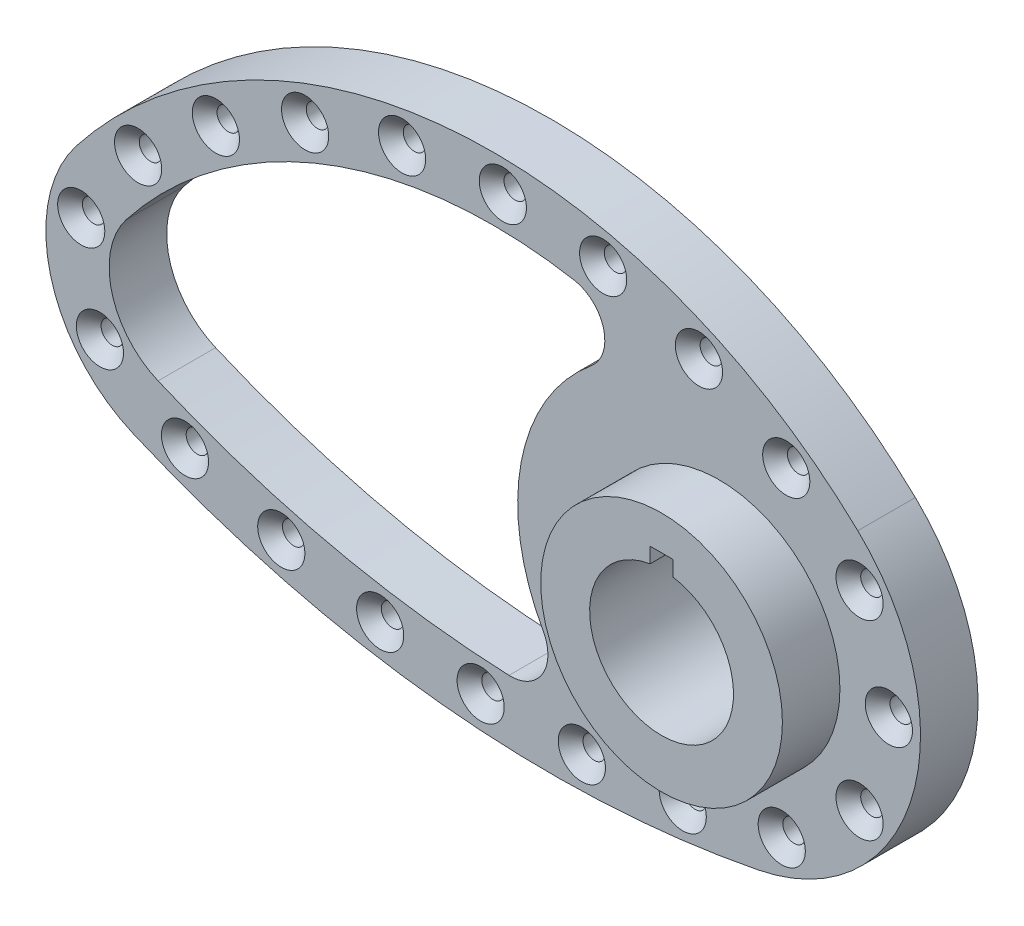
ISO-10303-21;
HEADER;
FILE_DESCRIPTION(('STEP AP214'),'2;1');
FILE_NAME('part.step','',(''),(''),'','','');
FILE_SCHEMA(('AUTOMOTIVE_DESIGN { 1 0 10303 214 1 1 1 1 }'));
ENDSEC;
DATA;
#1=APPLICATION_CONTEXT('core data for automotive mechanical design processes');
#2=APPLICATION_PROTOCOL_DEFINITION('international standard','automotive_design',2000,#1);
#3=PRODUCT_CONTEXT('',#1,'mechanical');
#4=PRODUCT('Part','Part','',(#3));
#5=PRODUCT_RELATED_PRODUCT_CATEGORY('part','',(#4));
#6=PRODUCT_DEFINITION_FORMATION('','',#4);
#7=PRODUCT_DEFINITION_CONTEXT('part definition',#1,'design');
#8=PRODUCT_DEFINITION('design','',#6,#7);
#9=PRODUCT_DEFINITION_SHAPE('','',#8);
#10=(LENGTH_UNIT() NAMED_UNIT(*) SI_UNIT(.MILLI.,.METRE.));
#11=(NAMED_UNIT(*) PLANE_ANGLE_UNIT() SI_UNIT($,.RADIAN.));
#12=(NAMED_UNIT(*) SI_UNIT($,.STERADIAN.) SOLID_ANGLE_UNIT());
#13=UNCERTAINTY_MEASURE_WITH_UNIT(LENGTH_MEASURE(1.E-05),#10,'distance_accuracy_value','');
#14=(GEOMETRIC_REPRESENTATION_CONTEXT(3) GLOBAL_UNCERTAINTY_ASSIGNED_CONTEXT((#13)) GLOBAL_UNIT_ASSIGNED_CONTEXT((#10,
#11,#12)) REPRESENTATION_CONTEXT('',''));
#15=CARTESIAN_POINT('',(0.,0.,0.));
#16=DIRECTION('',(0.,0.,1.));
#17=DIRECTION('',(1.,0.,0.));
#18=AXIS2_PLACEMENT_3D('',#15,#16,#17);
#19=CARTESIAN_POINT('',(-60.5760869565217,73.5699509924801,5.));
#20=DIRECTION('',(0.,0.,1.));
#21=DIRECTION('',(1.,0.,0.));
#22=AXIS2_PLACEMENT_3D('',#19,#20,#21);
#23=PLANE('',#22);
#24=CARTESIAN_POINT('',(24.4068739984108,-16.5696862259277,5.00000000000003));
#25=DIRECTION('',(0.,0.,1.));
#26=DIRECTION('',(1.,0.,0.));
#27=AXIS2_PLACEMENT_3D('',#24,#25,#26);
#28=CIRCLE('',#27,4.1);
#29=CARTESIAN_POINT('',(28.5068739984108,-16.5696862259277,5.00000000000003));
#30=VERTEX_POINT('',#29);
#31=EDGE_CURVE('E819',#30,#30,#28,.T.);
#32=ORIENTED_EDGE('',*,*,#31,.F.);
#33=EDGE_LOOP('',(#32));
#34=FACE_BOUND('',#33,.T.);
#35=CARTESIAN_POINT('',(10.8861354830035,-27.4179148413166,5.00000000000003));
#36=DIRECTION('',(0.,0.,1.));
#37=DIRECTION('',(1.,0.,0.));
#38=AXIS2_PLACEMENT_3D('',#35,#36,#37);
#39=CIRCLE('',#38,4.1);
#40=CARTESIAN_POINT('',(14.9861354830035,-27.4179148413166,5.00000000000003));
#41=VERTEX_POINT('',#40);
#42=EDGE_CURVE('E824',#41,#41,#39,.T.);
#43=ORIENTED_EDGE('',*,*,#42,.F.);
#44=EDGE_LOOP('',(#43));
#45=FACE_BOUND('',#44,.T.);
#46=CARTESIAN_POINT('',(-6.32000321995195,-30.90206492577,5.00000000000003));
#47=DIRECTION('',(0.,0.,1.));
#48=DIRECTION('',(1.,0.,0.));
#49=AXIS2_PLACEMENT_3D('',#46,#47,#48);
#50=CIRCLE('',#49,4.1);
#51=CARTESIAN_POINT('',(-2.22000321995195,-30.90206492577,5.00000000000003));
#52=VERTEX_POINT('',#51);
#53=EDGE_CURVE('E831',#52,#52,#50,.T.);
#54=ORIENTED_EDGE('',*,*,#53,.F.);
#55=EDGE_LOOP('',(#54));
#56=FACE_BOUND('',#55,.T.);
#57=CARTESIAN_POINT('',(-23.8531458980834,-32.2818645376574,5.00000000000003));
#58=DIRECTION('',(0.,0.,1.));
#59=DIRECTION('',(1.,0.,0.));
#60=AXIS2_PLACEMENT_3D('',#57,#58,#59);
#61=CIRCLE('',#60,4.1);
#62=CARTESIAN_POINT('',(-19.7531458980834,-32.2818645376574,5.00000000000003));
#63=VERTEX_POINT('',#62);
#64=EDGE_CURVE('E838',#63,#63,#61,.T.);
#65=ORIENTED_EDGE('',*,*,#64,.F.);
#66=EDGE_LOOP('',(#65));
#67=FACE_BOUND('',#66,.T.);
#68=CARTESIAN_POINT('',(-41.4371593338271,-31.9392121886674,5.00000000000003));
#69=DIRECTION('',(0.,0.,1.));
#70=DIRECTION('',(1.,0.,0.));
#71=AXIS2_PLACEMENT_3D('',#68,#69,#70);
#72=CIRCLE('',#71,4.1);
#73=CARTESIAN_POINT('',(-37.3371593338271,-31.9392121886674,5.00000000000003));
#74=VERTEX_POINT('',#73);
#75=EDGE_CURVE('E845',#74,#74,#72,.T.);
#76=ORIENTED_EDGE('',*,*,#75,.F.);
#77=EDGE_LOOP('',(#76));
#78=FACE_BOUND('',#77,.T.);
#79=CARTESIAN_POINT('',(-58.9032367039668,-29.8773973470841,5.00000000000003));
#80=DIRECTION('',(0.,0.,1.));
#81=DIRECTION('',(1.,0.,0.));
#82=AXIS2_PLACEMENT_3D('',#79,#80,#81);
#83=CIRCLE('',#82,4.1);
#84=CARTESIAN_POINT('',(-54.8032367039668,-29.8773973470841,5.00000000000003));
#85=VERTEX_POINT('',#84);
#86=EDGE_CURVE('E852',#85,#85,#83,.T.);
#87=ORIENTED_EDGE('',*,*,#86,.F.);
#88=EDGE_LOOP('',(#87));
#89=FACE_BOUND('',#88,.T.);
#90=CARTESIAN_POINT('',(-76.0837033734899,-26.1162134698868,5.00000000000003));
#91=DIRECTION('',(0.,0.,1.));
#92=DIRECTION('',(1.,0.,0.));
#93=AXIS2_PLACEMENT_3D('',#90,#91,#92);
#94=CIRCLE('',#93,4.09999999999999);
#95=CARTESIAN_POINT('',(-71.9837033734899,-26.1162134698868,5.00000000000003));
#96=VERTEX_POINT('',#95);
#97=EDGE_CURVE('E859',#96,#96,#94,.T.);
#98=ORIENTED_EDGE('',*,*,#97,.F.);
#99=EDGE_LOOP('',(#98));
#100=FACE_BOUND('',#99,.T.);
#101=CARTESIAN_POINT('',(-92.8136265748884,-20.6917679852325,5.00000000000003));
#102=DIRECTION('',(0.,0.,1.));
#103=DIRECTION('',(1.,0.,0.));
#104=AXIS2_PLACEMENT_3D('',#101,#102,#103);
#105=CIRCLE('',#104,4.09999999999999);
#106=CARTESIAN_POINT('',(-88.7136265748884,-20.6917679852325,5.00000000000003));
#107=VERTEX_POINT('',#106);
#108=EDGE_CURVE('E866',#107,#107,#105,.T.);
#109=ORIENTED_EDGE('',*,*,#108,.F.);
#110=EDGE_LOOP('',(#109));
#111=FACE_BOUND('',#110,.T.);
#112=CARTESIAN_POINT('',(-107.601326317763,-11.6982313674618,5.00000000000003));
#113=DIRECTION('',(0.,0.,1.));
#114=DIRECTION('',(1.,0.,0.));
#115=AXIS2_PLACEMENT_3D('',#112,#113,#114);
#116=CIRCLE('',#115,4.10000000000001);
#117=CARTESIAN_POINT('',(-103.501326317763,-11.6982313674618,5.00000000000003));
#118=VERTEX_POINT('',#117);
#119=EDGE_CURVE('E873',#118,#118,#116,.T.);
#120=ORIENTED_EDGE('',*,*,#119,.F.);
#121=EDGE_LOOP('',(#120));
#122=FACE_BOUND('',#121,.T.);
#123=CARTESIAN_POINT('',(-110.850163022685,4.99212920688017,5.00000000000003));
#124=DIRECTION('',(0.,0.,1.));
#125=DIRECTION('',(1.,0.,0.));
#126=AXIS2_PLACEMENT_3D('',#123,#124,#125);
#127=CIRCLE('',#126,4.10000000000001);
#128=CARTESIAN_POINT('',(-106.750163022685,4.99212920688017,5.00000000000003));
#129=VERTEX_POINT('',#128);
#130=EDGE_CURVE('E880',#129,#129,#127,.T.);
#131=ORIENTED_EDGE('',*,*,#130,.F.);
#132=EDGE_LOOP('',(#131));
#133=FACE_BOUND('',#132,.T.);
#134=CARTESIAN_POINT('',(-100.96391423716,19.2987237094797,5.00000000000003));
#135=DIRECTION('',(0.,0.,1.));
#136=DIRECTION('',(1.,0.,0.));
#137=AXIS2_PLACEMENT_3D('',#134,#135,#136);
#138=CIRCLE('',#137,4.10000000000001);
#139=CARTESIAN_POINT('',(-96.8639142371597,19.2987237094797,5.00000000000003));
#140=VERTEX_POINT('',#139);
#141=EDGE_CURVE('E887',#140,#140,#138,.T.);
#142=ORIENTED_EDGE('',*,*,#141,.F.);
#143=EDGE_LOOP('',(#142));
#144=FACE_BOUND('',#143,.T.);
#145=CARTESIAN_POINT('',(-87.4460912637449,30.5132387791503,5.00000000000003));
#146=DIRECTION('',(0.,0.,1.));
#147=DIRECTION('',(1.,0.,0.));
#148=AXIS2_PLACEMENT_3D('',#145,#146,#147);
#149=CIRCLE('',#148,4.09999999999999);
#150=CARTESIAN_POINT('',(-83.346091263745,30.5132387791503,5.00000000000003));
#151=VERTEX_POINT('',#150);
#152=EDGE_CURVE('E894',#151,#151,#149,.T.);
#153=ORIENTED_EDGE('',*,*,#152,.F.);
#154=EDGE_LOOP('',(#153));
#155=FACE_BOUND('',#154,.T.);
#156=CARTESIAN_POINT('',(-71.941567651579,38.7659131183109,5.00000000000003));
#157=DIRECTION('',(0.,0.,1.));
#158=DIRECTION('',(1.,0.,0.));
#159=AXIS2_PLACEMENT_3D('',#156,#157,#158);
#160=CIRCLE('',#159,4.09999999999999);
#161=CARTESIAN_POINT('',(-67.841567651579,38.7659131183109,5.00000000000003));
#162=VERTEX_POINT('',#161);
#163=EDGE_CURVE('E901',#162,#162,#160,.T.);
#164=ORIENTED_EDGE('',*,*,#163,.F.);
#165=EDGE_LOOP('',(#164));
#166=FACE_BOUND('',#165,.T.);
#167=CARTESIAN_POINT('',(-55.0896026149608,43.7164848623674,5.00000000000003));
#168=DIRECTION('',(0.,0.,1.));
#169=DIRECTION('',(1.,0.,0.));
#170=AXIS2_PLACEMENT_3D('',#167,#168,#169);
#171=CIRCLE('',#170,4.1);
#172=CARTESIAN_POINT('',(-50.9896026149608,43.7164848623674,5.00000000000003));
#173=VERTEX_POINT('',#172);
#174=EDGE_CURVE('E908',#173,#173,#171,.T.);
#175=ORIENTED_EDGE('',*,*,#174,.F.);
#176=EDGE_LOOP('',(#175));
#177=FACE_BOUND('',#176,.T.);
#178=CARTESIAN_POINT('',(-37.5850110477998,45.1608394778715,5.00000000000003));
#179=DIRECTION('',(0.,0.,1.));
#180=DIRECTION('',(1.,0.,0.));
#181=AXIS2_PLACEMENT_3D('',#178,#179,#180);
#182=CIRCLE('',#181,4.1);
#183=CARTESIAN_POINT('',(-33.4850110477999,45.1608394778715,5.00000000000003));
#184=VERTEX_POINT('',#183);
#185=EDGE_CURVE('E915',#184,#184,#182,.T.);
#186=ORIENTED_EDGE('',*,*,#185,.F.);
#187=EDGE_LOOP('',(#186));
#188=FACE_BOUND('',#187,.T.);
#189=CARTESIAN_POINT('',(-20.149515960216,43.0394255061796,5.00000000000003));
#190=DIRECTION('',(0.,0.,1.));
#191=DIRECTION('',(1.,0.,0.));
#192=AXIS2_PLACEMENT_3D('',#189,#190,#191);
#193=CIRCLE('',#192,4.1);
#194=CARTESIAN_POINT('',(-16.049515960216,43.0394255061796,5.00000000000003));
#195=VERTEX_POINT('',#194);
#196=EDGE_CURVE('E922',#195,#195,#193,.T.);
#197=ORIENTED_EDGE('',*,*,#196,.F.);
#198=EDGE_LOOP('',(#197));
#199=FACE_BOUND('',#198,.T.);
#200=CARTESIAN_POINT('',(-3.50199148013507,37.4397098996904,5.00000000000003));
#201=DIRECTION('',(0.,0.,1.));
#202=DIRECTION('',(1.,0.,0.));
#203=AXIS2_PLACEMENT_3D('',#200,#201,#202);
#204=CIRCLE('',#203,4.1);
#205=CARTESIAN_POINT('',(0.598008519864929,37.4397098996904,5.00000000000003));
#206=VERTEX_POINT('',#205);
#207=EDGE_CURVE('E929',#206,#206,#204,.T.);
#208=ORIENTED_EDGE('',*,*,#207,.F.);
#209=EDGE_LOOP('',(#208));
#210=FACE_BOUND('',#209,.T.);
#211=CARTESIAN_POINT('',(11.6711766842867,28.5925717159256,5.00000000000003));
#212=DIRECTION('',(0.,0.,1.));
#213=DIRECTION('',(1.,0.,0.));
#214=AXIS2_PLACEMENT_3D('',#211,#212,#213);
#215=CIRCLE('',#214,4.1);
#216=CARTESIAN_POINT('',(15.7711766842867,28.5925717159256,5.00000000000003));
#217=VERTEX_POINT('',#216);
#218=EDGE_CURVE('E936',#217,#217,#215,.T.);
#219=ORIENTED_EDGE('',*,*,#218,.F.);
#220=EDGE_LOOP('',(#219));
#221=FACE_BOUND('',#220,.T.);
#222=CARTESIAN_POINT('',(24.4068739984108,16.5696862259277,5.00000000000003));
#223=DIRECTION('',(0.,0.,1.));
#224=DIRECTION('',(1.,0.,0.));
#225=AXIS2_PLACEMENT_3D('',#222,#223,#224);
#226=CIRCLE('',#225,4.1);
#227=CARTESIAN_POINT('',(28.5068739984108,16.5696862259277,5.00000000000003));
#228=VERTEX_POINT('',#227);
#229=EDGE_CURVE('E943',#228,#228,#226,.T.);
#230=ORIENTED_EDGE('',*,*,#229,.F.);
#231=EDGE_LOOP('',(#230));
#232=FACE_BOUND('',#231,.T.);
#233=CARTESIAN_POINT('',(29.5,0.,5.));
#234=DIRECTION('',(0.,0.,1.));
#235=DIRECTION('',(1.,0.,0.));
#236=AXIS2_PLACEMENT_3D('',#233,#234,#235);
#237=CIRCLE('',#236,4.1);
#238=CARTESIAN_POINT('',(33.6,0.,5.));
#239=VERTEX_POINT('',#238);
#240=EDGE_CURVE('E950',#239,#239,#237,.T.);
#241=ORIENTED_EDGE('',*,*,#240,.F.);
#242=EDGE_LOOP('',(#241));
#243=FACE_BOUND('',#242,.T.);
#244=CARTESIAN_POINT('',(-92.,0.,5.));
#245=DIRECTION('',(0.,0.,1.));
#246=DIRECTION('',(1.,0.,0.));
#247=AXIS2_PLACEMENT_3D('',#244,#245,#246);
#248=CIRCLE('',#247,25.);
#249=CARTESIAN_POINT('',(-111.678780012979,15.4190018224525,5.));
#250=VERTEX_POINT('',#249);
#251=CARTESIAN_POINT('',(-101.819972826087,-22.9906096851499,5.));
#252=VERTEX_POINT('',#251);
#253=EDGE_CURVE('E261',#250,#252,#248,.T.);
#254=ORIENTED_EDGE('',*,*,#253,.T.);
#255=CARTESIAN_POINT('',(-29.1521739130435,147.13990198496,5.));
#256=DIRECTION('',(0.,0.,1.));
#257=DIRECTION('',(1.,0.,0.));
#258=AXIS2_PLACEMENT_3D('',#255,#256,#257);
#259=CIRCLE('',#258,185.);
#260=CARTESIAN_POINT('',(6.80217391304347,-34.3326437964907,5.));
#261=VERTEX_POINT('',#260);
#262=EDGE_CURVE('E264',#252,#261,#259,.T.);
#263=ORIENTED_EDGE('',*,*,#262,.T.);
#264=CARTESIAN_POINT('',(0.,0.,5.));
#265=DIRECTION('',(0.,0.,1.));
#266=DIRECTION('',(1.,0.,0.));
#267=AXIS2_PLACEMENT_3D('',#264,#265,#266);
#268=CIRCLE('',#267,35.);
#269=CARTESIAN_POINT('',(24.1075514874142,25.373725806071,5.));
#270=VERTEX_POINT('',#269);
#271=EDGE_CURVE('E266',#261,#270,#268,.T.);
#272=ORIENTED_EDGE('',*,*,#271,.T.);
#273=CARTESIAN_POINT('',(-39.2608695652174,-41.3229248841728,5.));
#274=DIRECTION('',(0.,0.,1.));
#275=DIRECTION('',(-1.,0.,0.));
#276=AXIS2_PLACEMENT_3D('',#273,#274,#275);
#277=CIRCLE('',#276,92.);
#278=EDGE_CURVE('E268',#270,#250,#277,.T.);
#279=ORIENTED_EDGE('',*,*,#278,.T.);
#280=EDGE_LOOP('',(#254,#263,#272,#279));
#281=FACE_BOUND('',#280,.T.);
#282=CARTESIAN_POINT('',(-26.3615126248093,32.0518431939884,5.));
#283=DIRECTION('',(0.,0.,1.));
#284=DIRECTION('',(-1.,0.,0.));
#285=AXIS2_PLACEMENT_3D('',#282,#283,#284);
#286=CIRCLE('',#285,6.5);
#287=CARTESIAN_POINT('',(-22.2326010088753,27.0316749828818,5.));
#288=VERTEX_POINT('',#287);
#289=CARTESIAN_POINT('',(-25.236065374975,38.453668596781,5.));
#290=VERTEX_POINT('',#289);
#291=EDGE_CURVE('E204',#288,#290,#286,.T.);
#292=ORIENTED_EDGE('',*,*,#291,.F.);
#293=CARTESIAN_POINT('',(0.,0.,5.));
#294=DIRECTION('',(0.,0.,-1.));
#295=DIRECTION('',(1.,0.,0.));
#296=AXIS2_PLACEMENT_3D('',#293,#294,#295);
#297=CIRCLE('',#296,35.);
#298=CARTESIAN_POINT('',(-30.569402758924,-17.0444012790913,5.));
#299=VERTEX_POINT('',#298);
#300=EDGE_CURVE('E218',#299,#288,#297,.T.);
#301=ORIENTED_EDGE('',*,*,#300,.F.);
#302=CARTESIAN_POINT('',(-36.2465775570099,-20.2097900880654,5.));
#303=DIRECTION('',(0.,0.,1.));
#304=DIRECTION('',(1.,0.,0.));
#305=AXIS2_PLACEMENT_3D('',#302,#303,#304);
#306=CIRCLE('',#305,6.5);
#307=CARTESIAN_POINT('',(-36.5218827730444,-26.7039572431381,5.));
#308=VERTEX_POINT('',#307);
#309=EDGE_CURVE('E215',#308,#299,#306,.T.);
#310=ORIENTED_EDGE('',*,*,#309,.F.);
#311=CARTESIAN_POINT('',(-29.1521739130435,147.13990198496,5.));
#312=DIRECTION('',(0.,0.,1.));
#313=DIRECTION('',(1.,0.,0.));
#314=AXIS2_PLACEMENT_3D('',#311,#312,#313);
#315=CIRCLE('',#314,174.);
#316=CARTESIAN_POINT('',(-97.4991847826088,-12.8747414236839,5.));
#317=VERTEX_POINT('',#316);
#318=EDGE_CURVE('E212',#317,#308,#315,.T.);
#319=ORIENTED_EDGE('',*,*,#318,.F.);
#320=CARTESIAN_POINT('',(-92.,0.,5.));
#321=DIRECTION('',(0.,0.,1.));
#322=DIRECTION('',(1.,0.,0.));
#323=AXIS2_PLACEMENT_3D('',#320,#321,#322);
#324=CIRCLE('',#323,14.);
#325=CARTESIAN_POINT('',(-103.020116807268,8.6346410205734,5.));
#326=VERTEX_POINT('',#325);
#327=EDGE_CURVE('E209',#326,#317,#324,.T.);
#328=ORIENTED_EDGE('',*,*,#327,.F.);
#329=CARTESIAN_POINT('',(-39.2608695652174,-41.3229248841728,5.));
#330=DIRECTION('',(0.,0.,1.));
#331=DIRECTION('',(1.,0.,0.));
#332=AXIS2_PLACEMENT_3D('',#329,#330,#331);
#333=CIRCLE('',#332,81.);
#334=EDGE_CURVE('E206',#290,#326,#333,.T.);
#335=ORIENTED_EDGE('',*,*,#334,.F.);
#336=EDGE_LOOP('',(#292,#301,#310,#319,#328,#335));
#337=FACE_BOUND('',#336,.T.);
#338=CARTESIAN_POINT('',(0.,0.,5.));
#339=DIRECTION('',(0.,0.,1.));
#340=DIRECTION('',(1.,0.,0.));
#341=AXIS2_PLACEMENT_3D('',#338,#339,#340);
#342=CIRCLE('',#341,21.);
#343=CARTESIAN_POINT('',(21.,0.,5.));
#344=VERTEX_POINT('',#343);
#345=EDGE_CURVE('E196',#344,#344,#342,.T.);
#346=ORIENTED_EDGE('',*,*,#345,.F.);
#347=EDGE_LOOP('',(#346));
#348=FACE_BOUND('',#347,.T.);
#349=ADVANCED_FACE('F61',(#34,#45,#56,#67,#78,#89,#100,#111,#122,#133,#144,#155,#166,#177,#188,
#199,#210,#221,#232,#243,#281,#337,#348),#23,.T.);
#350=CARTESIAN_POINT('',(-92.,0.,5.));
#351=DIRECTION('',(0.,0.,-1.));
#352=DIRECTION('',(-1.,0.,0.));
#353=AXIS2_PLACEMENT_3D('',#350,#351,#352);
#354=CYLINDRICAL_SURFACE('',#353,25.);
#355=CARTESIAN_POINT('',(-92.,0.,-5.));
#356=DIRECTION('',(0.,0.,1.));
#357=DIRECTION('',(1.,0.,0.));
#358=AXIS2_PLACEMENT_3D('',#355,#356,#357);
#359=CIRCLE('',#358,25.);
#360=CARTESIAN_POINT('',(-111.678780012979,15.4190018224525,-5.));
#361=VERTEX_POINT('',#360);
#362=CARTESIAN_POINT('',(-101.819972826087,-22.9906096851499,-5.));
#363=VERTEX_POINT('',#362);
#364=EDGE_CURVE('E242',#361,#363,#359,.T.);
#365=ORIENTED_EDGE('',*,*,#364,.T.);
#366=DIRECTION('',(0.,0.,-1.));
#367=VECTOR('',#366,1.);
#368=CARTESIAN_POINT('',(-101.819972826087,-22.9906096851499,5.));
#369=LINE('',#368,#367);
#370=EDGE_CURVE('E13',#252,#363,#369,.T.);
#371=ORIENTED_EDGE('',*,*,#370,.F.);
#372=ORIENTED_EDGE('',*,*,#253,.F.);
#373=DIRECTION('',(0.,0.,-1.));
#374=VECTOR('',#373,1.);
#375=CARTESIAN_POINT('',(-111.678780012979,15.4190018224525,5.));
#376=LINE('',#375,#374);
#377=EDGE_CURVE('E270',#250,#361,#376,.T.);
#378=ORIENTED_EDGE('',*,*,#377,.T.);
#379=EDGE_LOOP('',(#365,#371,#372,#378));
#380=FACE_BOUND('',#379,.T.);
#381=ADVANCED_FACE('F63',(#380),#354,.T.);
#382=CARTESIAN_POINT('',(-29.1521739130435,147.13990198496,5.));
#383=DIRECTION('',(0.,0.,-1.));
#384=DIRECTION('',(-1.,0.,0.));
#385=AXIS2_PLACEMENT_3D('',#382,#383,#384);
#386=CYLINDRICAL_SURFACE('',#385,185.);
#387=CARTESIAN_POINT('',(-29.1521739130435,147.13990198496,-5.));
#388=DIRECTION('',(0.,0.,1.));
#389=DIRECTION('',(1.,0.,0.));
#390=AXIS2_PLACEMENT_3D('',#387,#388,#389);
#391=CIRCLE('',#390,185.);
#392=CARTESIAN_POINT('',(6.80217391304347,-34.3326437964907,-5.));
#393=VERTEX_POINT('',#392);
#394=EDGE_CURVE('E255',#363,#393,#391,.T.);
#395=ORIENTED_EDGE('',*,*,#394,.T.);
#396=DIRECTION('',(0.,0.,-1.));
#397=VECTOR('',#396,1.);
#398=CARTESIAN_POINT('',(6.80217391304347,-34.3326437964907,5.));
#399=LINE('',#398,#397);
#400=EDGE_CURVE('E69',#261,#393,#399,.T.);
#401=ORIENTED_EDGE('',*,*,#400,.F.);
#402=ORIENTED_EDGE('',*,*,#262,.F.);
#403=ORIENTED_EDGE('',*,*,#370,.T.);
#404=EDGE_LOOP('',(#395,#401,#402,#403));
#405=FACE_BOUND('',#404,.T.);
#406=ADVANCED_FACE('F296',(#405),#386,.T.);
#407=CARTESIAN_POINT('',(0.,0.,5.));
#408=DIRECTION('',(0.,0.,-1.));
#409=DIRECTION('',(-1.,0.,0.));
#410=AXIS2_PLACEMENT_3D('',#407,#408,#409);
#411=CYLINDRICAL_SURFACE('',#410,35.);
#412=CARTESIAN_POINT('',(0.,0.,-5.));
#413=DIRECTION('',(0.,0.,1.));
#414=DIRECTION('',(1.,0.,0.));
#415=AXIS2_PLACEMENT_3D('',#412,#413,#414);
#416=CIRCLE('',#415,35.);
#417=CARTESIAN_POINT('',(24.1075514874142,25.373725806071,-5.));
#418=VERTEX_POINT('',#417);
#419=EDGE_CURVE('E257',#393,#418,#416,.T.);
#420=ORIENTED_EDGE('',*,*,#419,.T.);
#421=DIRECTION('',(0.,0.,-1.));
#422=VECTOR('',#421,1.);
#423=CARTESIAN_POINT('',(24.1075514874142,25.373725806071,5.));
#424=LINE('',#423,#422);
#425=EDGE_CURVE('E273',#270,#418,#424,.T.);
#426=ORIENTED_EDGE('',*,*,#425,.F.);
#427=ORIENTED_EDGE('',*,*,#271,.F.);
#428=ORIENTED_EDGE('',*,*,#400,.T.);
#429=EDGE_LOOP('',(#420,#426,#427,#428));
#430=FACE_BOUND('',#429,.T.);
#431=ADVANCED_FACE('F280',(#430),#411,.T.);
#432=CARTESIAN_POINT('',(-39.2608695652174,-41.3229248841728,5.));
#433=DIRECTION('',(0.,0.,-1.));
#434=DIRECTION('',(-1.,0.,0.));
#435=AXIS2_PLACEMENT_3D('',#432,#433,#434);
#436=CYLINDRICAL_SURFACE('',#435,92.);
#437=CARTESIAN_POINT('',(-39.2608695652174,-41.3229248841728,-5.));
#438=DIRECTION('',(0.,0.,1.));
#439=DIRECTION('',(-1.,0.,0.));
#440=AXIS2_PLACEMENT_3D('',#437,#438,#439);
#441=CIRCLE('',#440,92.);
#442=EDGE_CURVE('E259',#418,#361,#441,.T.);
#443=ORIENTED_EDGE('',*,*,#442,.T.);
#444=ORIENTED_EDGE('',*,*,#377,.F.);
#445=ORIENTED_EDGE('',*,*,#278,.F.);
#446=ORIENTED_EDGE('',*,*,#425,.T.);
#447=EDGE_LOOP('',(#443,#444,#445,#446));
#448=FACE_BOUND('',#447,.T.);
#449=ADVANCED_FACE('F289',(#448),#436,.T.);
#450=CARTESIAN_POINT('',(-60.5760869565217,73.5699509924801,-5.));
#451=DIRECTION('',(0.,0.,1.));
#452=DIRECTION('',(1.,0.,0.));
#453=AXIS2_PLACEMENT_3D('',#450,#451,#452);
#454=PLANE('',#453);
#455=CARTESIAN_POINT('',(24.4068739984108,-16.5696862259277,-4.99999999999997));
#456=DIRECTION('',(0.,0.,1.));
#457=DIRECTION('',(1.,0.,0.));
#458=AXIS2_PLACEMENT_3D('',#455,#456,#457);
#459=CIRCLE('',#458,1.94999999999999);
#460=CARTESIAN_POINT('',(26.3568739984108,-16.5696862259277,-4.99999999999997));
#461=VERTEX_POINT('',#460);
#462=EDGE_CURVE('E329',#461,#461,#459,.T.);
#463=ORIENTED_EDGE('',*,*,#462,.T.);
#464=EDGE_LOOP('',(#463));
#465=FACE_BOUND('',#464,.T.);
#466=CARTESIAN_POINT('',(10.8861354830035,-27.4179148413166,-4.99999999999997));
#467=DIRECTION('',(0.,0.,1.));
#468=DIRECTION('',(1.,0.,0.));
#469=AXIS2_PLACEMENT_3D('',#466,#467,#468);
#470=CIRCLE('',#469,1.94999999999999);
#471=CARTESIAN_POINT('',(12.8361354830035,-27.4179148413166,-4.99999999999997));
#472=VERTEX_POINT('',#471);
#473=EDGE_CURVE('E333',#472,#472,#470,.T.);
#474=ORIENTED_EDGE('',*,*,#473,.T.);
#475=EDGE_LOOP('',(#474));
#476=FACE_BOUND('',#475,.T.);
#477=CARTESIAN_POINT('',(-6.32000321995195,-30.90206492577,-4.99999999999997));
#478=DIRECTION('',(0.,0.,1.));
#479=DIRECTION('',(1.,0.,0.));
#480=AXIS2_PLACEMENT_3D('',#477,#478,#479);
#481=CIRCLE('',#480,1.94999999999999);
#482=CARTESIAN_POINT('',(-4.37000321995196,-30.90206492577,-4.99999999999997));
#483=VERTEX_POINT('',#482);
#484=EDGE_CURVE('E337',#483,#483,#481,.T.);
#485=ORIENTED_EDGE('',*,*,#484,.T.);
#486=EDGE_LOOP('',(#485));
#487=FACE_BOUND('',#486,.T.);
#488=CARTESIAN_POINT('',(-23.8531458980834,-32.2818645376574,-4.99999999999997));
#489=DIRECTION('',(0.,0.,1.));
#490=DIRECTION('',(1.,0.,0.));
#491=AXIS2_PLACEMENT_3D('',#488,#489,#490);
#492=CIRCLE('',#491,1.94999999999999);
#493=CARTESIAN_POINT('',(-21.9031458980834,-32.2818645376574,-4.99999999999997));
#494=VERTEX_POINT('',#493);
#495=EDGE_CURVE('E341',#494,#494,#492,.T.);
#496=ORIENTED_EDGE('',*,*,#495,.T.);
#497=EDGE_LOOP('',(#496));
#498=FACE_BOUND('',#497,.T.);
#499=CARTESIAN_POINT('',(-41.4371593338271,-31.9392121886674,-4.99999999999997));
#500=DIRECTION('',(0.,0.,1.));
#501=DIRECTION('',(1.,0.,0.));
#502=AXIS2_PLACEMENT_3D('',#499,#500,#501);
#503=CIRCLE('',#502,1.94999999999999);
#504=CARTESIAN_POINT('',(-39.4871593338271,-31.9392121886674,-4.99999999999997));
#505=VERTEX_POINT('',#504);
#506=EDGE_CURVE('E345',#505,#505,#503,.T.);
#507=ORIENTED_EDGE('',*,*,#506,.T.);
#508=EDGE_LOOP('',(#507));
#509=FACE_BOUND('',#508,.T.);
#510=CARTESIAN_POINT('',(-58.9032367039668,-29.8773973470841,-4.99999999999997));
#511=DIRECTION('',(0.,0.,1.));
#512=DIRECTION('',(1.,0.,0.));
#513=AXIS2_PLACEMENT_3D('',#510,#511,#512);
#514=CIRCLE('',#513,1.94999999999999);
#515=CARTESIAN_POINT('',(-56.9532367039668,-29.8773973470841,-4.99999999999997));
#516=VERTEX_POINT('',#515);
#517=EDGE_CURVE('E349',#516,#516,#514,.T.);
#518=ORIENTED_EDGE('',*,*,#517,.T.);
#519=EDGE_LOOP('',(#518));
#520=FACE_BOUND('',#519,.T.);
#521=CARTESIAN_POINT('',(-76.0837033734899,-26.1162134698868,-4.99999999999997));
#522=DIRECTION('',(0.,0.,1.));
#523=DIRECTION('',(1.,0.,0.));
#524=AXIS2_PLACEMENT_3D('',#521,#522,#523);
#525=CIRCLE('',#524,1.94999999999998);
#526=CARTESIAN_POINT('',(-74.1337033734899,-26.1162134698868,-4.99999999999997));
#527=VERTEX_POINT('',#526);
#528=EDGE_CURVE('E353',#527,#527,#525,.T.);
#529=ORIENTED_EDGE('',*,*,#528,.T.);
#530=EDGE_LOOP('',(#529));
#531=FACE_BOUND('',#530,.T.);
#532=CARTESIAN_POINT('',(-92.8136265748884,-20.6917679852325,-4.99999999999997));
#533=DIRECTION('',(0.,0.,1.));
#534=DIRECTION('',(1.,0.,0.));
#535=AXIS2_PLACEMENT_3D('',#532,#533,#534);
#536=CIRCLE('',#535,1.94999999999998);
#537=CARTESIAN_POINT('',(-90.8636265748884,-20.6917679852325,-4.99999999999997));
#538=VERTEX_POINT('',#537);
#539=EDGE_CURVE('E357',#538,#538,#536,.T.);
#540=ORIENTED_EDGE('',*,*,#539,.T.);
#541=EDGE_LOOP('',(#540));
#542=FACE_BOUND('',#541,.T.);
#543=CARTESIAN_POINT('',(-107.601326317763,-11.6982313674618,-4.99999999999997));
#544=DIRECTION('',(0.,0.,1.));
#545=DIRECTION('',(1.,0.,0.));
#546=AXIS2_PLACEMENT_3D('',#543,#544,#545);
#547=CIRCLE('',#546,1.94999999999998);
#548=CARTESIAN_POINT('',(-105.651326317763,-11.6982313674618,-4.99999999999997));
#549=VERTEX_POINT('',#548);
#550=EDGE_CURVE('E361',#549,#549,#547,.T.);
#551=ORIENTED_EDGE('',*,*,#550,.T.);
#552=EDGE_LOOP('',(#551));
#553=FACE_BOUND('',#552,.T.);
#554=CARTESIAN_POINT('',(-110.850163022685,4.99212920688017,-4.99999999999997));
#555=DIRECTION('',(0.,0.,1.));
#556=DIRECTION('',(1.,0.,0.));
#557=AXIS2_PLACEMENT_3D('',#554,#555,#556);
#558=CIRCLE('',#557,1.94999999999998);
#559=CARTESIAN_POINT('',(-108.900163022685,4.99212920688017,-4.99999999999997));
#560=VERTEX_POINT('',#559);
#561=EDGE_CURVE('E365',#560,#560,#558,.T.);
#562=ORIENTED_EDGE('',*,*,#561,.T.);
#563=EDGE_LOOP('',(#562));
#564=FACE_BOUND('',#563,.T.);
#565=CARTESIAN_POINT('',(-100.96391423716,19.2987237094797,-4.99999999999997));
#566=DIRECTION('',(0.,0.,1.));
#567=DIRECTION('',(1.,0.,0.));
#568=AXIS2_PLACEMENT_3D('',#565,#566,#567);
#569=CIRCLE('',#568,1.94999999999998);
#570=CARTESIAN_POINT('',(-99.0139142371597,19.2987237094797,-4.99999999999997));
#571=VERTEX_POINT('',#570);
#572=EDGE_CURVE('E369',#571,#571,#569,.T.);
#573=ORIENTED_EDGE('',*,*,#572,.T.);
#574=EDGE_LOOP('',(#573));
#575=FACE_BOUND('',#574,.T.);
#576=CARTESIAN_POINT('',(-87.4460912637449,30.5132387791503,-4.99999999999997));
#577=DIRECTION('',(0.,0.,1.));
#578=DIRECTION('',(1.,0.,0.));
#579=AXIS2_PLACEMENT_3D('',#576,#577,#578);
#580=CIRCLE('',#579,1.94999999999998);
#581=CARTESIAN_POINT('',(-85.496091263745,30.5132387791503,-4.99999999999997));
#582=VERTEX_POINT('',#581);
#583=EDGE_CURVE('E373',#582,#582,#580,.T.);
#584=ORIENTED_EDGE('',*,*,#583,.T.);
#585=EDGE_LOOP('',(#584));
#586=FACE_BOUND('',#585,.T.);
#587=CARTESIAN_POINT('',(-71.941567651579,38.7659131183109,-4.99999999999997));
#588=DIRECTION('',(0.,0.,1.));
#589=DIRECTION('',(1.,0.,0.));
#590=AXIS2_PLACEMENT_3D('',#587,#588,#589);
#591=CIRCLE('',#590,1.94999999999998);
#592=CARTESIAN_POINT('',(-69.991567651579,38.7659131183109,-4.99999999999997));
#593=VERTEX_POINT('',#592);
#594=EDGE_CURVE('E377',#593,#593,#591,.T.);
#595=ORIENTED_EDGE('',*,*,#594,.T.);
#596=EDGE_LOOP('',(#595));
#597=FACE_BOUND('',#596,.T.);
#598=CARTESIAN_POINT('',(-55.0896026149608,43.7164848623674,-4.99999999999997));
#599=DIRECTION('',(0.,0.,1.));
#600=DIRECTION('',(1.,0.,0.));
#601=AXIS2_PLACEMENT_3D('',#598,#599,#600);
#602=CIRCLE('',#601,1.94999999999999);
#603=CARTESIAN_POINT('',(-53.1396026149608,43.7164848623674,-4.99999999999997));
#604=VERTEX_POINT('',#603);
#605=EDGE_CURVE('E381',#604,#604,#602,.T.);
#606=ORIENTED_EDGE('',*,*,#605,.T.);
#607=EDGE_LOOP('',(#606));
#608=FACE_BOUND('',#607,.T.);
#609=CARTESIAN_POINT('',(-37.5850110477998,45.1608394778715,-4.99999999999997));
#610=DIRECTION('',(0.,0.,1.));
#611=DIRECTION('',(1.,0.,0.));
#612=AXIS2_PLACEMENT_3D('',#609,#610,#611);
#613=CIRCLE('',#612,1.94999999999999);
#614=CARTESIAN_POINT('',(-35.6350110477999,45.1608394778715,-4.99999999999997));
#615=VERTEX_POINT('',#614);
#616=EDGE_CURVE('E385',#615,#615,#613,.T.);
#617=ORIENTED_EDGE('',*,*,#616,.T.);
#618=EDGE_LOOP('',(#617));
#619=FACE_BOUND('',#618,.T.);
#620=CARTESIAN_POINT('',(-20.149515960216,43.0394255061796,-4.99999999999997));
#621=DIRECTION('',(0.,0.,1.));
#622=DIRECTION('',(1.,0.,0.));
#623=AXIS2_PLACEMENT_3D('',#620,#621,#622);
#624=CIRCLE('',#623,1.94999999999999);
#625=CARTESIAN_POINT('',(-18.199515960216,43.0394255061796,-4.99999999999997));
#626=VERTEX_POINT('',#625);
#627=EDGE_CURVE('E389',#626,#626,#624,.T.);
#628=ORIENTED_EDGE('',*,*,#627,.T.);
#629=EDGE_LOOP('',(#628));
#630=FACE_BOUND('',#629,.T.);
#631=CARTESIAN_POINT('',(-3.50199148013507,37.4397098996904,-4.99999999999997));
#632=DIRECTION('',(0.,0.,1.));
#633=DIRECTION('',(1.,0.,0.));
#634=AXIS2_PLACEMENT_3D('',#631,#632,#633);
#635=CIRCLE('',#634,1.94999999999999);
#636=CARTESIAN_POINT('',(-1.55199148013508,37.4397098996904,-4.99999999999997));
#637=VERTEX_POINT('',#636);
#638=EDGE_CURVE('E393',#637,#637,#635,.T.);
#639=ORIENTED_EDGE('',*,*,#638,.T.);
#640=EDGE_LOOP('',(#639));
#641=FACE_BOUND('',#640,.T.);
#642=CARTESIAN_POINT('',(11.6711766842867,28.5925717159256,-4.99999999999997));
#643=DIRECTION('',(0.,0.,1.));
#644=DIRECTION('',(1.,0.,0.));
#645=AXIS2_PLACEMENT_3D('',#642,#643,#644);
#646=CIRCLE('',#645,1.94999999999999);
#647=CARTESIAN_POINT('',(13.6211766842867,28.5925717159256,-4.99999999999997));
#648=VERTEX_POINT('',#647);
#649=EDGE_CURVE('E397',#648,#648,#646,.T.);
#650=ORIENTED_EDGE('',*,*,#649,.T.);
#651=EDGE_LOOP('',(#650));
#652=FACE_BOUND('',#651,.T.);
#653=CARTESIAN_POINT('',(24.4068739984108,16.5696862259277,-4.99999999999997));
#654=DIRECTION('',(0.,0.,1.));
#655=DIRECTION('',(1.,0.,0.));
#656=AXIS2_PLACEMENT_3D('',#653,#654,#655);
#657=CIRCLE('',#656,1.94999999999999);
#658=CARTESIAN_POINT('',(26.3568739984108,16.5696862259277,-4.99999999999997));
#659=VERTEX_POINT('',#658);
#660=EDGE_CURVE('E401',#659,#659,#657,.T.);
#661=ORIENTED_EDGE('',*,*,#660,.T.);
#662=EDGE_LOOP('',(#661));
#663=FACE_BOUND('',#662,.T.);
#664=CARTESIAN_POINT('',(29.5,0.,-4.99999999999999));
#665=DIRECTION('',(0.,0.,1.));
#666=DIRECTION('',(1.,0.,0.));
#667=AXIS2_PLACEMENT_3D('',#664,#665,#666);
#668=CIRCLE('',#667,1.94999999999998);
#669=CARTESIAN_POINT('',(31.45,0.,-4.99999999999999));
#670=VERTEX_POINT('',#669);
#671=EDGE_CURVE('E405',#670,#670,#668,.T.);
#672=ORIENTED_EDGE('',*,*,#671,.T.);
#673=EDGE_LOOP('',(#672));
#674=FACE_BOUND('',#673,.T.);
#675=DIRECTION('',(0.,-1.,0.));
#676=VECTOR('',#675,1.);
#677=CARTESIAN_POINT('',(-2.,12.3389626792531,-5.));
#678=LINE('',#677,#676);
#679=CARTESIAN_POINT('',(-2.,15.,-5.));
#680=VERTEX_POINT('',#679);
#681=CARTESIAN_POINT('',(-2.,12.3389626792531,-5.));
#682=VERTEX_POINT('',#681);
#683=EDGE_CURVE('E191',#680,#682,#678,.T.);
#684=ORIENTED_EDGE('',*,*,#683,.T.);
#685=CARTESIAN_POINT('',(0.,0.,-5.));
#686=DIRECTION('',(0.,0.,1.));
#687=DIRECTION('',(1.,0.,0.));
#688=AXIS2_PLACEMENT_3D('',#685,#686,#687);
#689=CIRCLE('',#688,12.5);
#690=CARTESIAN_POINT('',(2.,12.3389626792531,-5.));
#691=VERTEX_POINT('',#690);
#692=EDGE_CURVE('E182',#682,#691,#689,.T.);
#693=ORIENTED_EDGE('',*,*,#692,.T.);
#694=DIRECTION('',(0.,1.,0.));
#695=VECTOR('',#694,1.);
#696=CARTESIAN_POINT('',(2.,12.3389626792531,-5.));
#697=LINE('',#696,#695);
#698=CARTESIAN_POINT('',(2.,15.,-5.));
#699=VERTEX_POINT('',#698);
#700=EDGE_CURVE('E188',#691,#699,#697,.T.);
#701=ORIENTED_EDGE('',*,*,#700,.T.);
#702=DIRECTION('',(-1.,0.,0.));
#703=VECTOR('',#702,1.);
#704=CARTESIAN_POINT('',(-2.,15.,-5.));
#705=LINE('',#704,#703);
#706=EDGE_CURVE('E76',#699,#680,#705,.T.);
#707=ORIENTED_EDGE('',*,*,#706,.T.);
#708=EDGE_LOOP('',(#684,#693,#701,#707));
#709=FACE_BOUND('',#708,.T.);
#710=CARTESIAN_POINT('',(0.,0.,-5.));
#711=DIRECTION('',(0.,0.,-1.));
#712=DIRECTION('',(1.,0.,0.));
#713=AXIS2_PLACEMENT_3D('',#710,#711,#712);
#714=CIRCLE('',#713,35.);
#715=CARTESIAN_POINT('',(-30.569402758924,-17.0444012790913,-5.));
#716=VERTEX_POINT('',#715);
#717=CARTESIAN_POINT('',(-22.2326010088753,27.0316749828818,-5.));
#718=VERTEX_POINT('',#717);
#719=EDGE_CURVE('E236',#716,#718,#714,.T.);
#720=ORIENTED_EDGE('',*,*,#719,.T.);
#721=CARTESIAN_POINT('',(-26.3615126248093,32.0518431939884,-5.));
#722=DIRECTION('',(0.,0.,1.));
#723=DIRECTION('',(-1.,0.,0.));
#724=AXIS2_PLACEMENT_3D('',#721,#722,#723);
#725=CIRCLE('',#724,6.5);
#726=CARTESIAN_POINT('',(-25.236065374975,38.453668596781,-5.));
#727=VERTEX_POINT('',#726);
#728=EDGE_CURVE('E221',#718,#727,#725,.T.);
#729=ORIENTED_EDGE('',*,*,#728,.T.);
#730=CARTESIAN_POINT('',(-39.2608695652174,-41.3229248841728,-5.));
#731=DIRECTION('',(0.,0.,1.));
#732=DIRECTION('',(1.,0.,0.));
#733=AXIS2_PLACEMENT_3D('',#730,#731,#732);
#734=CIRCLE('',#733,81.);
#735=CARTESIAN_POINT('',(-103.020116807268,8.6346410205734,-5.));
#736=VERTEX_POINT('',#735);
#737=EDGE_CURVE('E224',#727,#736,#734,.T.);
#738=ORIENTED_EDGE('',*,*,#737,.T.);
#739=CARTESIAN_POINT('',(-92.,0.,-5.));
#740=DIRECTION('',(0.,0.,1.));
#741=DIRECTION('',(1.,0.,0.));
#742=AXIS2_PLACEMENT_3D('',#739,#740,#741);
#743=CIRCLE('',#742,14.);
#744=CARTESIAN_POINT('',(-97.4991847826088,-12.8747414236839,-5.));
#745=VERTEX_POINT('',#744);
#746=EDGE_CURVE('E227',#736,#745,#743,.T.);
#747=ORIENTED_EDGE('',*,*,#746,.T.);
#748=CARTESIAN_POINT('',(-29.1521739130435,147.13990198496,-5.));
#749=DIRECTION('',(0.,0.,1.));
#750=DIRECTION('',(1.,0.,0.));
#751=AXIS2_PLACEMENT_3D('',#748,#749,#750);
#752=CIRCLE('',#751,174.);
#753=CARTESIAN_POINT('',(-36.5218827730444,-26.7039572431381,-5.));
#754=VERTEX_POINT('',#753);
#755=EDGE_CURVE('E230',#745,#754,#752,.T.);
#756=ORIENTED_EDGE('',*,*,#755,.T.);
#757=CARTESIAN_POINT('',(-36.2465775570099,-20.2097900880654,-5.));
#758=DIRECTION('',(0.,0.,1.));
#759=DIRECTION('',(1.,0.,0.));
#760=AXIS2_PLACEMENT_3D('',#757,#758,#759);
#761=CIRCLE('',#760,6.5);
#762=EDGE_CURVE('E233',#754,#716,#761,.T.);
#763=ORIENTED_EDGE('',*,*,#762,.T.);
#764=EDGE_LOOP('',(#720,#729,#738,#747,#756,#763));
#765=FACE_BOUND('',#764,.T.);
#766=ORIENTED_EDGE('',*,*,#364,.F.);
#767=ORIENTED_EDGE('',*,*,#442,.F.);
#768=ORIENTED_EDGE('',*,*,#419,.F.);
#769=ORIENTED_EDGE('',*,*,#394,.F.);
#770=EDGE_LOOP('',(#766,#767,#768,#769));
#771=FACE_BOUND('',#770,.T.);
#772=ADVANCED_FACE('F286',(#465,#476,#487,#498,#509,#520,#531,#542,#553,#564,#575,#586,#597,
#608,#619,#630,#641,#652,#663,#674,#709,#765,#771),#454,.F.);
#773=CARTESIAN_POINT('',(-26.3615126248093,32.0518431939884,-5.));
#774=DIRECTION('',(0.,0.,1.));
#775=DIRECTION('',(1.,0.,0.));
#776=AXIS2_PLACEMENT_3D('',#773,#774,#775);
#777=CYLINDRICAL_SURFACE('',#776,6.5);
#778=ORIENTED_EDGE('',*,*,#291,.T.);
#779=DIRECTION('',(0.,0.,1.));
#780=VECTOR('',#779,1.);
#781=CARTESIAN_POINT('',(-25.236065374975,38.453668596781,-5.));
#782=LINE('',#781,#780);
#783=EDGE_CURVE('E239',#727,#290,#782,.T.);
#784=ORIENTED_EDGE('',*,*,#783,.F.);
#785=ORIENTED_EDGE('',*,*,#728,.F.);
#786=DIRECTION('',(0.,0.,1.));
#787=VECTOR('',#786,1.);
#788=CARTESIAN_POINT('',(-22.2326010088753,27.0316749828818,-5.));
#789=LINE('',#788,#787);
#790=EDGE_CURVE('E240',#718,#288,#789,.T.);
#791=ORIENTED_EDGE('',*,*,#790,.T.);
#792=EDGE_LOOP('',(#778,#784,#785,#791));
#793=FACE_BOUND('',#792,.T.);
#794=ADVANCED_FACE('F319',(#793),#777,.F.);
#795=CARTESIAN_POINT('',(0.,0.,-5.));
#796=DIRECTION('',(0.,0.,1.));
#797=DIRECTION('',(1.,0.,0.));
#798=AXIS2_PLACEMENT_3D('',#795,#796,#797);
#799=CYLINDRICAL_SURFACE('',#798,35.);
#800=ORIENTED_EDGE('',*,*,#300,.T.);
#801=ORIENTED_EDGE('',*,*,#790,.F.);
#802=ORIENTED_EDGE('',*,*,#719,.F.);
#803=DIRECTION('',(0.,0.,1.));
#804=VECTOR('',#803,1.);
#805=CARTESIAN_POINT('',(-30.569402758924,-17.0444012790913,-5.));
#806=LINE('',#805,#804);
#807=EDGE_CURVE('E243',#716,#299,#806,.T.);
#808=ORIENTED_EDGE('',*,*,#807,.T.);
#809=EDGE_LOOP('',(#800,#801,#802,#808));
#810=FACE_BOUND('',#809,.T.);
#811=ADVANCED_FACE('F324',(#810),#799,.T.);
#812=CARTESIAN_POINT('',(-36.2465775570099,-20.2097900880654,-5.));
#813=DIRECTION('',(0.,0.,1.));
#814=DIRECTION('',(1.,0.,0.));
#815=AXIS2_PLACEMENT_3D('',#812,#813,#814);
#816=CYLINDRICAL_SURFACE('',#815,6.5);
#817=ORIENTED_EDGE('',*,*,#309,.T.);
#818=ORIENTED_EDGE('',*,*,#807,.F.);
#819=ORIENTED_EDGE('',*,*,#762,.F.);
#820=DIRECTION('',(0.,0.,1.));
#821=VECTOR('',#820,1.);
#822=CARTESIAN_POINT('',(-36.5218827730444,-26.7039572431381,-5.));
#823=LINE('',#822,#821);
#824=EDGE_CURVE('E245',#754,#308,#823,.T.);
#825=ORIENTED_EDGE('',*,*,#824,.T.);
#826=EDGE_LOOP('',(#817,#818,#819,#825));
#827=FACE_BOUND('',#826,.T.);
#828=ADVANCED_FACE('F428',(#827),#816,.F.);
#829=CARTESIAN_POINT('',(-29.1521739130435,147.13990198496,-5.));
#830=DIRECTION('',(0.,0.,1.));
#831=DIRECTION('',(1.,0.,0.));
#832=AXIS2_PLACEMENT_3D('',#829,#830,#831);
#833=CYLINDRICAL_SURFACE('',#832,174.);
#834=ORIENTED_EDGE('',*,*,#318,.T.);
#835=ORIENTED_EDGE('',*,*,#824,.F.);
#836=ORIENTED_EDGE('',*,*,#755,.F.);
#837=DIRECTION('',(0.,0.,1.));
#838=VECTOR('',#837,1.);
#839=CARTESIAN_POINT('',(-97.4991847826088,-12.8747414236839,-5.));
#840=LINE('',#839,#838);
#841=EDGE_CURVE('E247',#745,#317,#840,.T.);
#842=ORIENTED_EDGE('',*,*,#841,.T.);
#843=EDGE_LOOP('',(#834,#835,#836,#842));
#844=FACE_BOUND('',#843,.T.);
#845=ADVANCED_FACE('F425',(#844),#833,.F.);
#846=CARTESIAN_POINT('',(-92.,0.,-5.));
#847=DIRECTION('',(0.,0.,1.));
#848=DIRECTION('',(1.,0.,0.));
#849=AXIS2_PLACEMENT_3D('',#846,#847,#848);
#850=CYLINDRICAL_SURFACE('',#849,14.);
#851=ORIENTED_EDGE('',*,*,#327,.T.);
#852=ORIENTED_EDGE('',*,*,#841,.F.);
#853=ORIENTED_EDGE('',*,*,#746,.F.);
#854=DIRECTION('',(0.,0.,1.));
#855=VECTOR('',#854,1.);
#856=CARTESIAN_POINT('',(-103.020116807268,8.6346410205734,-5.));
#857=LINE('',#856,#855);
#858=EDGE_CURVE('E249',#736,#326,#857,.T.);
#859=ORIENTED_EDGE('',*,*,#858,.T.);
#860=EDGE_LOOP('',(#851,#852,#853,#859));
#861=FACE_BOUND('',#860,.T.);
#862=ADVANCED_FACE('F421',(#861),#850,.F.);
#863=CARTESIAN_POINT('',(-39.2608695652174,-41.3229248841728,-5.));
#864=DIRECTION('',(0.,0.,1.));
#865=DIRECTION('',(1.,0.,0.));
#866=AXIS2_PLACEMENT_3D('',#863,#864,#865);
#867=CYLINDRICAL_SURFACE('',#866,81.);
#868=ORIENTED_EDGE('',*,*,#334,.T.);
#869=ORIENTED_EDGE('',*,*,#858,.F.);
#870=ORIENTED_EDGE('',*,*,#737,.F.);
#871=ORIENTED_EDGE('',*,*,#783,.T.);
#872=EDGE_LOOP('',(#868,#869,#870,#871));
#873=FACE_BOUND('',#872,.T.);
#874=ADVANCED_FACE('F418',(#873),#867,.F.);
#875=CARTESIAN_POINT('',(0.,0.,15.));
#876=DIRECTION('',(0.,0.,-1.));
#877=DIRECTION('',(-1.,0.,0.));
#878=AXIS2_PLACEMENT_3D('',#875,#876,#877);
#879=CYLINDRICAL_SURFACE('',#878,21.);
#880=CARTESIAN_POINT('',(0.,0.,15.));
#881=DIRECTION('',(0.,0.,1.));
#882=DIRECTION('',(1.,0.,0.));
#883=AXIS2_PLACEMENT_3D('',#880,#881,#882);
#884=CIRCLE('',#883,21.);
#885=CARTESIAN_POINT('',(21.,0.,15.));
#886=VERTEX_POINT('',#885);
#887=EDGE_CURVE('E201',#886,#886,#884,.T.);
#888=ORIENTED_EDGE('',*,*,#887,.F.);
#889=EDGE_LOOP('',(#888));
#890=FACE_BOUND('',#889,.T.);
#891=ORIENTED_EDGE('',*,*,#345,.T.);
#892=EDGE_LOOP('',(#891));
#893=FACE_BOUND('',#892,.T.);
#894=ADVANCED_FACE('F432',(#890,#893),#879,.T.);
#895=CARTESIAN_POINT('',(0.,0.,15.));
#896=DIRECTION('',(0.,0.,1.));
#897=DIRECTION('',(1.,0.,0.));
#898=AXIS2_PLACEMENT_3D('',#895,#896,#897);
#899=PLANE('',#898);
#900=CARTESIAN_POINT('',(0.,0.,15.));
#901=DIRECTION('',(0.,0.,1.));
#902=DIRECTION('',(1.,0.,0.));
#903=AXIS2_PLACEMENT_3D('',#900,#901,#902);
#904=CIRCLE('',#903,12.5);
#905=CARTESIAN_POINT('',(-2.,12.3389626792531,15.));
#906=VERTEX_POINT('',#905);
#907=CARTESIAN_POINT('',(2.,12.3389626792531,15.));
#908=VERTEX_POINT('',#907);
#909=EDGE_CURVE('E84',#906,#908,#904,.T.);
#910=ORIENTED_EDGE('',*,*,#909,.F.);
#911=DIRECTION('',(0.,-1.,0.));
#912=VECTOR('',#911,1.);
#913=CARTESIAN_POINT('',(-2.,12.3389626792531,15.));
#914=LINE('',#913,#912);
#915=CARTESIAN_POINT('',(-2.,15.,15.));
#916=VERTEX_POINT('',#915);
#917=EDGE_CURVE('E180',#916,#906,#914,.T.);
#918=ORIENTED_EDGE('',*,*,#917,.F.);
#919=DIRECTION('',(-1.,0.,0.));
#920=VECTOR('',#919,1.);
#921=CARTESIAN_POINT('',(-2.,15.,15.));
#922=LINE('',#921,#920);
#923=CARTESIAN_POINT('',(2.,15.,15.));
#924=VERTEX_POINT('',#923);
#925=EDGE_CURVE('E164',#924,#916,#922,.T.);
#926=ORIENTED_EDGE('',*,*,#925,.F.);
#927=DIRECTION('',(0.,1.,0.));
#928=VECTOR('',#927,1.);
#929=CARTESIAN_POINT('',(2.,12.3389626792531,15.));
#930=LINE('',#929,#928);
#931=EDGE_CURVE('E173',#908,#924,#930,.T.);
#932=ORIENTED_EDGE('',*,*,#931,.F.);
#933=EDGE_LOOP('',(#910,#918,#926,#932));
#934=FACE_BOUND('',#933,.T.);
#935=ORIENTED_EDGE('',*,*,#887,.T.);
#936=EDGE_LOOP('',(#935));
#937=FACE_BOUND('',#936,.T.);
#938=ADVANCED_FACE('F177',(#934,#937),#899,.T.);
#939=CARTESIAN_POINT('',(0.,0.,-5.));
#940=DIRECTION('',(0.,0.,1.));
#941=DIRECTION('',(1.,0.,0.));
#942=AXIS2_PLACEMENT_3D('',#939,#940,#941);
#943=CYLINDRICAL_SURFACE('',#942,12.5);
#944=ORIENTED_EDGE('',*,*,#909,.T.);
#945=DIRECTION('',(0.,0.,1.));
#946=VECTOR('',#945,1.);
#947=CARTESIAN_POINT('',(2.,12.3389626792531,-5.));
#948=LINE('',#947,#946);
#949=EDGE_CURVE('E170',#691,#908,#948,.T.);
#950=ORIENTED_EDGE('',*,*,#949,.F.);
#951=ORIENTED_EDGE('',*,*,#692,.F.);
#952=DIRECTION('',(0.,0.,1.));
#953=VECTOR('',#952,1.);
#954=CARTESIAN_POINT('',(-2.,12.3389626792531,-5.));
#955=LINE('',#954,#953);
#956=EDGE_CURVE('E194',#682,#906,#955,.T.);
#957=ORIENTED_EDGE('',*,*,#956,.T.);
#958=EDGE_LOOP('',(#944,#950,#951,#957));
#959=FACE_BOUND('',#958,.T.);
#960=ADVANCED_FACE('F440',(#959),#943,.F.);
#961=CARTESIAN_POINT('',(-2.,12.3389626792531,-5.));
#962=DIRECTION('',(-1.,0.,0.));
#963=DIRECTION('',(0.,0.,1.));
#964=AXIS2_PLACEMENT_3D('',#961,#962,#963);
#965=PLANE('',#964);
#966=ORIENTED_EDGE('',*,*,#917,.T.);
#967=ORIENTED_EDGE('',*,*,#956,.F.);
#968=ORIENTED_EDGE('',*,*,#683,.F.);
#969=DIRECTION('',(0.,0.,1.));
#970=VECTOR('',#969,1.);
#971=CARTESIAN_POINT('',(-2.,15.,-5.));
#972=LINE('',#971,#970);
#973=EDGE_CURVE('E169',#680,#916,#972,.T.);
#974=ORIENTED_EDGE('',*,*,#973,.T.);
#975=EDGE_LOOP('',(#966,#967,#968,#974));
#976=FACE_BOUND('',#975,.T.);
#977=ADVANCED_FACE('F476',(#976),#965,.F.);
#978=CARTESIAN_POINT('',(-2.,15.,-5.));
#979=DIRECTION('',(0.,1.,0.));
#980=DIRECTION('',(0.,0.,1.));
#981=AXIS2_PLACEMENT_3D('',#978,#979,#980);
#982=PLANE('',#981);
#983=ORIENTED_EDGE('',*,*,#925,.T.);
#984=ORIENTED_EDGE('',*,*,#973,.F.);
#985=ORIENTED_EDGE('',*,*,#706,.F.);
#986=DIRECTION('',(0.,0.,1.));
#987=VECTOR('',#986,1.);
#988=CARTESIAN_POINT('',(2.,15.,-5.));
#989=LINE('',#988,#987);
#990=EDGE_CURVE('E160',#699,#924,#989,.T.);
#991=ORIENTED_EDGE('',*,*,#990,.T.);
#992=EDGE_LOOP('',(#983,#984,#985,#991));
#993=FACE_BOUND('',#992,.T.);
#994=ADVANCED_FACE('F162',(#993),#982,.F.);
#995=CARTESIAN_POINT('',(2.,12.3389626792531,-5.));
#996=DIRECTION('',(1.,0.,0.));
#997=DIRECTION('',(0.,1.,0.));
#998=AXIS2_PLACEMENT_3D('',#995,#996,#997);
#999=PLANE('',#998);
#1000=ORIENTED_EDGE('',*,*,#931,.T.);
#1001=ORIENTED_EDGE('',*,*,#990,.F.);
#1002=ORIENTED_EDGE('',*,*,#700,.F.);
#1003=ORIENTED_EDGE('',*,*,#949,.T.);
#1004=EDGE_LOOP('',(#1000,#1001,#1002,#1003));
#1005=FACE_BOUND('',#1004,.T.);
#1006=ADVANCED_FACE('F174',(#1005),#999,.F.);
#1007=CARTESIAN_POINT('',(29.5,0.,5.));
#1008=DIRECTION('',(0.,0.,1.));
#1009=DIRECTION('',(1.,0.,0.));
#1010=AXIS2_PLACEMENT_3D('',#1007,#1008,#1009);
#1011=CYLINDRICAL_SURFACE('',#1010,1.94999999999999);
#1012=ORIENTED_EDGE('',*,*,#671,.F.);
#1013=EDGE_LOOP('',(#1012));
#1014=FACE_BOUND('',#1013,.T.);
#1015=CARTESIAN_POINT('',(29.5,0.,2.85));
#1016=DIRECTION('',(0.,0.,1.));
#1017=DIRECTION('',(1.,0.,0.));
#1018=AXIS2_PLACEMENT_3D('',#1015,#1016,#1017);
#1019=CIRCLE('',#1018,1.95);
#1020=CARTESIAN_POINT('',(31.45,0.,2.85));
#1021=VERTEX_POINT('',#1020);
#1022=EDGE_CURVE('E953',#1021,#1021,#1019,.T.);
#1023=ORIENTED_EDGE('',*,*,#1022,.T.);
#1024=EDGE_LOOP('',(#1023));
#1025=FACE_BOUND('',#1024,.T.);
#1026=ADVANCED_FACE('F495',(#1014,#1025),#1011,.F.);
#1027=CARTESIAN_POINT('',(29.5,0.,5.));
#1028=DIRECTION('',(0.,0.,1.));
#1029=DIRECTION('',(1.,0.,0.));
#1030=AXIS2_PLACEMENT_3D('',#1027,#1028,#1029);
#1031=CONICAL_SURFACE('',#1030,4.1,0.785398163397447);
#1032=ORIENTED_EDGE('',*,*,#1022,.F.);
#1033=EDGE_LOOP('',(#1032));
#1034=FACE_BOUND('',#1033,.T.);
#1035=ORIENTED_EDGE('',*,*,#240,.T.);
#1036=EDGE_LOOP('',(#1035));
#1037=FACE_BOUND('',#1036,.T.);
#1038=ADVANCED_FACE('F502',(#1034,#1037),#1031,.F.);
#1039=CARTESIAN_POINT('',(24.4068739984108,16.5696862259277,5.00000000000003));
#1040=DIRECTION('',(0.,0.,1.));
#1041=DIRECTION('',(1.,0.,0.));
#1042=AXIS2_PLACEMENT_3D('',#1039,#1040,#1041);
#1043=CYLINDRICAL_SURFACE('',#1042,1.94999999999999);
#1044=ORIENTED_EDGE('',*,*,#660,.F.);
#1045=EDGE_LOOP('',(#1044));
#1046=FACE_BOUND('',#1045,.T.);
#1047=CARTESIAN_POINT('',(24.4068739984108,16.5696862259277,2.85000000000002));
#1048=DIRECTION('',(0.,0.,1.));
#1049=DIRECTION('',(1.,0.,0.));
#1050=AXIS2_PLACEMENT_3D('',#1047,#1048,#1049);
#1051=CIRCLE('',#1050,1.95);
#1052=CARTESIAN_POINT('',(26.3568739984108,16.5696862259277,2.85000000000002));
#1053=VERTEX_POINT('',#1052);
#1054=EDGE_CURVE('E946',#1053,#1053,#1051,.T.);
#1055=ORIENTED_EDGE('',*,*,#1054,.T.);
#1056=EDGE_LOOP('',(#1055));
#1057=FACE_BOUND('',#1056,.T.);
#1058=ADVANCED_FACE('F509',(#1046,#1057),#1043,.F.);
#1059=CARTESIAN_POINT('',(24.4068739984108,16.5696862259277,5.00000000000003));
#1060=DIRECTION('',(0.,0.,1.));
#1061=DIRECTION('',(1.,0.,0.));
#1062=AXIS2_PLACEMENT_3D('',#1059,#1060,#1061);
#1063=CONICAL_SURFACE('',#1062,4.1,0.785398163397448);
#1064=ORIENTED_EDGE('',*,*,#1054,.F.);
#1065=EDGE_LOOP('',(#1064));
#1066=FACE_BOUND('',#1065,.T.);
#1067=ORIENTED_EDGE('',*,*,#229,.T.);
#1068=EDGE_LOOP('',(#1067));
#1069=FACE_BOUND('',#1068,.T.);
#1070=ADVANCED_FACE('F516',(#1066,#1069),#1063,.F.);
#1071=CARTESIAN_POINT('',(11.6711766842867,28.5925717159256,5.00000000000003));
#1072=DIRECTION('',(0.,0.,1.));
#1073=DIRECTION('',(1.,0.,0.));
#1074=AXIS2_PLACEMENT_3D('',#1071,#1072,#1073);
#1075=CYLINDRICAL_SURFACE('',#1074,1.94999999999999);
#1076=ORIENTED_EDGE('',*,*,#649,.F.);
#1077=EDGE_LOOP('',(#1076));
#1078=FACE_BOUND('',#1077,.T.);
#1079=CARTESIAN_POINT('',(11.6711766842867,28.5925717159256,2.85000000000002));
#1080=DIRECTION('',(0.,0.,1.));
#1081=DIRECTION('',(1.,0.,0.));
#1082=AXIS2_PLACEMENT_3D('',#1079,#1080,#1081);
#1083=CIRCLE('',#1082,1.95);
#1084=CARTESIAN_POINT('',(13.6211766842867,28.5925717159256,2.85000000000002));
#1085=VERTEX_POINT('',#1084);
#1086=EDGE_CURVE('E939',#1085,#1085,#1083,.T.);
#1087=ORIENTED_EDGE('',*,*,#1086,.T.);
#1088=EDGE_LOOP('',(#1087));
#1089=FACE_BOUND('',#1088,.T.);
#1090=ADVANCED_FACE('F524',(#1078,#1089),#1075,.F.);
#1091=CARTESIAN_POINT('',(11.6711766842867,28.5925717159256,5.00000000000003));
#1092=DIRECTION('',(0.,0.,1.));
#1093=DIRECTION('',(1.,0.,0.));
#1094=AXIS2_PLACEMENT_3D('',#1091,#1092,#1093);
#1095=CONICAL_SURFACE('',#1094,4.1,0.785398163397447);
#1096=ORIENTED_EDGE('',*,*,#1086,.F.);
#1097=EDGE_LOOP('',(#1096));
#1098=FACE_BOUND('',#1097,.T.);
#1099=ORIENTED_EDGE('',*,*,#218,.T.);
#1100=EDGE_LOOP('',(#1099));
#1101=FACE_BOUND('',#1100,.T.);
#1102=ADVANCED_FACE('F532',(#1098,#1101),#1095,.F.);
#1103=CARTESIAN_POINT('',(-3.50199148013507,37.4397098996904,5.00000000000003));
#1104=DIRECTION('',(0.,0.,1.));
#1105=DIRECTION('',(1.,0.,0.));
#1106=AXIS2_PLACEMENT_3D('',#1103,#1104,#1105);
#1107=CYLINDRICAL_SURFACE('',#1106,1.94999999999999);
#1108=ORIENTED_EDGE('',*,*,#638,.F.);
#1109=EDGE_LOOP('',(#1108));
#1110=FACE_BOUND('',#1109,.T.);
#1111=CARTESIAN_POINT('',(-3.50199148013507,37.4397098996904,2.85000000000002));
#1112=DIRECTION('',(0.,0.,1.));
#1113=DIRECTION('',(1.,0.,0.));
#1114=AXIS2_PLACEMENT_3D('',#1111,#1112,#1113);
#1115=CIRCLE('',#1114,1.95);
#1116=CARTESIAN_POINT('',(-1.55199148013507,37.4397098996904,2.85000000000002));
#1117=VERTEX_POINT('',#1116);
#1118=EDGE_CURVE('E932',#1117,#1117,#1115,.T.);
#1119=ORIENTED_EDGE('',*,*,#1118,.T.);
#1120=EDGE_LOOP('',(#1119));
#1121=FACE_BOUND('',#1120,.T.);
#1122=ADVANCED_FACE('F540',(#1110,#1121),#1107,.F.);
#1123=CARTESIAN_POINT('',(-3.50199148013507,37.4397098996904,5.00000000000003));
#1124=DIRECTION('',(0.,0.,1.));
#1125=DIRECTION('',(1.,0.,0.));
#1126=AXIS2_PLACEMENT_3D('',#1123,#1124,#1125);
#1127=CONICAL_SURFACE('',#1126,4.1,0.785398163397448);
#1128=ORIENTED_EDGE('',*,*,#1118,.F.);
#1129=EDGE_LOOP('',(#1128));
#1130=FACE_BOUND('',#1129,.T.);
#1131=ORIENTED_EDGE('',*,*,#207,.T.);
#1132=EDGE_LOOP('',(#1131));
#1133=FACE_BOUND('',#1132,.T.);
#1134=ADVANCED_FACE('F548',(#1130,#1133),#1127,.F.);
#1135=CARTESIAN_POINT('',(-20.149515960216,43.0394255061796,5.00000000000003));
#1136=DIRECTION('',(0.,0.,1.));
#1137=DIRECTION('',(1.,0.,0.));
#1138=AXIS2_PLACEMENT_3D('',#1135,#1136,#1137);
#1139=CYLINDRICAL_SURFACE('',#1138,1.94999999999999);
#1140=ORIENTED_EDGE('',*,*,#627,.F.);
#1141=EDGE_LOOP('',(#1140));
#1142=FACE_BOUND('',#1141,.T.);
#1143=CARTESIAN_POINT('',(-20.149515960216,43.0394255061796,2.85000000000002));
#1144=DIRECTION('',(0.,0.,1.));
#1145=DIRECTION('',(1.,0.,0.));
#1146=AXIS2_PLACEMENT_3D('',#1143,#1144,#1145);
#1147=CIRCLE('',#1146,1.95);
#1148=CARTESIAN_POINT('',(-18.199515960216,43.0394255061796,2.85000000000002));
#1149=VERTEX_POINT('',#1148);
#1150=EDGE_CURVE('E925',#1149,#1149,#1147,.T.);
#1151=ORIENTED_EDGE('',*,*,#1150,.T.);
#1152=EDGE_LOOP('',(#1151));
#1153=FACE_BOUND('',#1152,.T.);
#1154=ADVANCED_FACE('F556',(#1142,#1153),#1139,.F.);
#1155=CARTESIAN_POINT('',(-20.149515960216,43.0394255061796,5.00000000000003));
#1156=DIRECTION('',(0.,0.,1.));
#1157=DIRECTION('',(1.,0.,0.));
#1158=AXIS2_PLACEMENT_3D('',#1155,#1156,#1157);
#1159=CONICAL_SURFACE('',#1158,4.1,0.785398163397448);
#1160=ORIENTED_EDGE('',*,*,#1150,.F.);
#1161=EDGE_LOOP('',(#1160));
#1162=FACE_BOUND('',#1161,.T.);
#1163=ORIENTED_EDGE('',*,*,#196,.T.);
#1164=EDGE_LOOP('',(#1163));
#1165=FACE_BOUND('',#1164,.T.);
#1166=ADVANCED_FACE('F564',(#1162,#1165),#1159,.F.);
#1167=CARTESIAN_POINT('',(-37.5850110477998,45.1608394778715,5.00000000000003));
#1168=DIRECTION('',(0.,0.,1.));
#1169=DIRECTION('',(1.,0.,0.));
#1170=AXIS2_PLACEMENT_3D('',#1167,#1168,#1169);
#1171=CYLINDRICAL_SURFACE('',#1170,1.94999999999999);
#1172=ORIENTED_EDGE('',*,*,#616,.F.);
#1173=EDGE_LOOP('',(#1172));
#1174=FACE_BOUND('',#1173,.T.);
#1175=CARTESIAN_POINT('',(-37.5850110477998,45.1608394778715,2.85000000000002));
#1176=DIRECTION('',(0.,0.,1.));
#1177=DIRECTION('',(1.,0.,0.));
#1178=AXIS2_PLACEMENT_3D('',#1175,#1176,#1177);
#1179=CIRCLE('',#1178,1.95);
#1180=CARTESIAN_POINT('',(-35.6350110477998,45.1608394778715,2.85000000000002));
#1181=VERTEX_POINT('',#1180);
#1182=EDGE_CURVE('E918',#1181,#1181,#1179,.T.);
#1183=ORIENTED_EDGE('',*,*,#1182,.T.);
#1184=EDGE_LOOP('',(#1183));
#1185=FACE_BOUND('',#1184,.T.);
#1186=ADVANCED_FACE('F572',(#1174,#1185),#1171,.F.);
#1187=CARTESIAN_POINT('',(-37.5850110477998,45.1608394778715,5.00000000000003));
#1188=DIRECTION('',(0.,0.,1.));
#1189=DIRECTION('',(1.,0.,0.));
#1190=AXIS2_PLACEMENT_3D('',#1187,#1188,#1189);
#1191=CONICAL_SURFACE('',#1190,4.1,0.785398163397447);
#1192=ORIENTED_EDGE('',*,*,#1182,.F.);
#1193=EDGE_LOOP('',(#1192));
#1194=FACE_BOUND('',#1193,.T.);
#1195=ORIENTED_EDGE('',*,*,#185,.T.);
#1196=EDGE_LOOP('',(#1195));
#1197=FACE_BOUND('',#1196,.T.);
#1198=ADVANCED_FACE('F580',(#1194,#1197),#1191,.F.);
#1199=CARTESIAN_POINT('',(-55.0896026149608,43.7164848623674,5.00000000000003));
#1200=DIRECTION('',(0.,0.,1.));
#1201=DIRECTION('',(1.,0.,0.));
#1202=AXIS2_PLACEMENT_3D('',#1199,#1200,#1201);
#1203=CYLINDRICAL_SURFACE('',#1202,1.94999999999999);
#1204=ORIENTED_EDGE('',*,*,#605,.F.);
#1205=EDGE_LOOP('',(#1204));
#1206=FACE_BOUND('',#1205,.T.);
#1207=CARTESIAN_POINT('',(-55.0896026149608,43.7164848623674,2.85000000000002));
#1208=DIRECTION('',(0.,0.,1.));
#1209=DIRECTION('',(1.,0.,0.));
#1210=AXIS2_PLACEMENT_3D('',#1207,#1208,#1209);
#1211=CIRCLE('',#1210,1.95);
#1212=CARTESIAN_POINT('',(-53.1396026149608,43.7164848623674,2.85000000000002));
#1213=VERTEX_POINT('',#1212);
#1214=EDGE_CURVE('E911',#1213,#1213,#1211,.T.);
#1215=ORIENTED_EDGE('',*,*,#1214,.T.);
#1216=EDGE_LOOP('',(#1215));
#1217=FACE_BOUND('',#1216,.T.);
#1218=ADVANCED_FACE('F588',(#1206,#1217),#1203,.F.);
#1219=CARTESIAN_POINT('',(-55.0896026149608,43.7164848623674,5.00000000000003));
#1220=DIRECTION('',(0.,0.,1.));
#1221=DIRECTION('',(1.,0.,0.));
#1222=AXIS2_PLACEMENT_3D('',#1219,#1220,#1221);
#1223=CONICAL_SURFACE('',#1222,4.1,0.785398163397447);
#1224=ORIENTED_EDGE('',*,*,#1214,.F.);
#1225=EDGE_LOOP('',(#1224));
#1226=FACE_BOUND('',#1225,.T.);
#1227=ORIENTED_EDGE('',*,*,#174,.T.);
#1228=EDGE_LOOP('',(#1227));
#1229=FACE_BOUND('',#1228,.T.);
#1230=ADVANCED_FACE('F596',(#1226,#1229),#1223,.F.);
#1231=CARTESIAN_POINT('',(-71.941567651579,38.7659131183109,5.00000000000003));
#1232=DIRECTION('',(0.,0.,1.));
#1233=DIRECTION('',(1.,0.,0.));
#1234=AXIS2_PLACEMENT_3D('',#1231,#1232,#1233);
#1235=CYLINDRICAL_SURFACE('',#1234,1.94999999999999);
#1236=ORIENTED_EDGE('',*,*,#594,.F.);
#1237=EDGE_LOOP('',(#1236));
#1238=FACE_BOUND('',#1237,.T.);
#1239=CARTESIAN_POINT('',(-71.941567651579,38.7659131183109,2.85000000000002));
#1240=DIRECTION('',(0.,0.,1.));
#1241=DIRECTION('',(1.,0.,0.));
#1242=AXIS2_PLACEMENT_3D('',#1239,#1240,#1241);
#1243=CIRCLE('',#1242,1.94999999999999);
#1244=CARTESIAN_POINT('',(-69.991567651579,38.7659131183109,2.85000000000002));
#1245=VERTEX_POINT('',#1244);
#1246=EDGE_CURVE('E904',#1245,#1245,#1243,.T.);
#1247=ORIENTED_EDGE('',*,*,#1246,.T.);
#1248=EDGE_LOOP('',(#1247));
#1249=FACE_BOUND('',#1248,.T.);
#1250=ADVANCED_FACE('F604',(#1238,#1249),#1235,.F.);
#1251=CARTESIAN_POINT('',(-71.941567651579,38.7659131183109,5.00000000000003));
#1252=DIRECTION('',(0.,0.,1.));
#1253=DIRECTION('',(1.,0.,0.));
#1254=AXIS2_PLACEMENT_3D('',#1251,#1252,#1253);
#1255=CONICAL_SURFACE('',#1254,4.09999999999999,0.785398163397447);
#1256=ORIENTED_EDGE('',*,*,#1246,.F.);
#1257=EDGE_LOOP('',(#1256));
#1258=FACE_BOUND('',#1257,.T.);
#1259=ORIENTED_EDGE('',*,*,#163,.T.);
#1260=EDGE_LOOP('',(#1259));
#1261=FACE_BOUND('',#1260,.T.);
#1262=ADVANCED_FACE('F612',(#1258,#1261),#1255,.F.);
#1263=CARTESIAN_POINT('',(-87.4460912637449,30.5132387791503,5.00000000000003));
#1264=DIRECTION('',(0.,0.,1.));
#1265=DIRECTION('',(1.,0.,0.));
#1266=AXIS2_PLACEMENT_3D('',#1263,#1264,#1265);
#1267=CYLINDRICAL_SURFACE('',#1266,1.94999999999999);
#1268=ORIENTED_EDGE('',*,*,#583,.F.);
#1269=EDGE_LOOP('',(#1268));
#1270=FACE_BOUND('',#1269,.T.);
#1271=CARTESIAN_POINT('',(-87.4460912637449,30.5132387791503,2.85000000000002));
#1272=DIRECTION('',(0.,0.,1.));
#1273=DIRECTION('',(1.,0.,0.));
#1274=AXIS2_PLACEMENT_3D('',#1271,#1272,#1273);
#1275=CIRCLE('',#1274,1.94999999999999);
#1276=CARTESIAN_POINT('',(-85.496091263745,30.5132387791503,2.85000000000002));
#1277=VERTEX_POINT('',#1276);
#1278=EDGE_CURVE('E897',#1277,#1277,#1275,.T.);
#1279=ORIENTED_EDGE('',*,*,#1278,.T.);
#1280=EDGE_LOOP('',(#1279));
#1281=FACE_BOUND('',#1280,.T.);
#1282=ADVANCED_FACE('F620',(#1270,#1281),#1267,.F.);
#1283=CARTESIAN_POINT('',(-87.4460912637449,30.5132387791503,5.00000000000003));
#1284=DIRECTION('',(0.,0.,1.));
#1285=DIRECTION('',(1.,0.,0.));
#1286=AXIS2_PLACEMENT_3D('',#1283,#1284,#1285);
#1287=CONICAL_SURFACE('',#1286,4.09999999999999,0.785398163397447);
#1288=ORIENTED_EDGE('',*,*,#1278,.F.);
#1289=EDGE_LOOP('',(#1288));
#1290=FACE_BOUND('',#1289,.T.);
#1291=ORIENTED_EDGE('',*,*,#152,.T.);
#1292=EDGE_LOOP('',(#1291));
#1293=FACE_BOUND('',#1292,.T.);
#1294=ADVANCED_FACE('F628',(#1290,#1293),#1287,.F.);
#1295=CARTESIAN_POINT('',(-100.96391423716,19.2987237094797,5.00000000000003));
#1296=DIRECTION('',(0.,0.,1.));
#1297=DIRECTION('',(1.,0.,0.));
#1298=AXIS2_PLACEMENT_3D('',#1295,#1296,#1297);
#1299=CYLINDRICAL_SURFACE('',#1298,1.94999999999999);
#1300=ORIENTED_EDGE('',*,*,#572,.F.);
#1301=EDGE_LOOP('',(#1300));
#1302=FACE_BOUND('',#1301,.T.);
#1303=CARTESIAN_POINT('',(-100.96391423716,19.2987237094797,2.85000000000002));
#1304=DIRECTION('',(0.,0.,1.));
#1305=DIRECTION('',(1.,0.,0.));
#1306=AXIS2_PLACEMENT_3D('',#1303,#1304,#1305);
#1307=CIRCLE('',#1306,1.94999999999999);
#1308=CARTESIAN_POINT('',(-99.0139142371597,19.2987237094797,2.85000000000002));
#1309=VERTEX_POINT('',#1308);
#1310=EDGE_CURVE('E890',#1309,#1309,#1307,.T.);
#1311=ORIENTED_EDGE('',*,*,#1310,.T.);
#1312=EDGE_LOOP('',(#1311));
#1313=FACE_BOUND('',#1312,.T.);
#1314=ADVANCED_FACE('F636',(#1302,#1313),#1299,.F.);
#1315=CARTESIAN_POINT('',(-100.96391423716,19.2987237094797,5.00000000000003));
#1316=DIRECTION('',(0.,0.,1.));
#1317=DIRECTION('',(1.,0.,0.));
#1318=AXIS2_PLACEMENT_3D('',#1315,#1316,#1317);
#1319=CONICAL_SURFACE('',#1318,4.10000000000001,0.78539816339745);
#1320=ORIENTED_EDGE('',*,*,#1310,.F.);
#1321=EDGE_LOOP('',(#1320));
#1322=FACE_BOUND('',#1321,.T.);
#1323=ORIENTED_EDGE('',*,*,#141,.T.);
#1324=EDGE_LOOP('',(#1323));
#1325=FACE_BOUND('',#1324,.T.);
#1326=ADVANCED_FACE('F644',(#1322,#1325),#1319,.F.);
#1327=CARTESIAN_POINT('',(-110.850163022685,4.99212920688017,5.00000000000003));
#1328=DIRECTION('',(0.,0.,1.));
#1329=DIRECTION('',(1.,0.,0.));
#1330=AXIS2_PLACEMENT_3D('',#1327,#1328,#1329);
#1331=CYLINDRICAL_SURFACE('',#1330,1.94999999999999);
#1332=ORIENTED_EDGE('',*,*,#561,.F.);
#1333=EDGE_LOOP('',(#1332));
#1334=FACE_BOUND('',#1333,.T.);
#1335=CARTESIAN_POINT('',(-110.850163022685,4.99212920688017,2.85000000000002));
#1336=DIRECTION('',(0.,0.,1.));
#1337=DIRECTION('',(1.,0.,0.));
#1338=AXIS2_PLACEMENT_3D('',#1335,#1336,#1337);
#1339=CIRCLE('',#1338,1.94999999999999);
#1340=CARTESIAN_POINT('',(-108.900163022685,4.99212920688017,2.85000000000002));
#1341=VERTEX_POINT('',#1340);
#1342=EDGE_CURVE('E883',#1341,#1341,#1339,.T.);
#1343=ORIENTED_EDGE('',*,*,#1342,.T.);
#1344=EDGE_LOOP('',(#1343));
#1345=FACE_BOUND('',#1344,.T.);
#1346=ADVANCED_FACE('F652',(#1334,#1345),#1331,.F.);
#1347=CARTESIAN_POINT('',(-110.850163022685,4.99212920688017,5.00000000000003));
#1348=DIRECTION('',(0.,0.,1.));
#1349=DIRECTION('',(1.,0.,0.));
#1350=AXIS2_PLACEMENT_3D('',#1347,#1348,#1349);
#1351=CONICAL_SURFACE('',#1350,4.10000000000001,0.78539816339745);
#1352=ORIENTED_EDGE('',*,*,#1342,.F.);
#1353=EDGE_LOOP('',(#1352));
#1354=FACE_BOUND('',#1353,.T.);
#1355=ORIENTED_EDGE('',*,*,#130,.T.);
#1356=EDGE_LOOP('',(#1355));
#1357=FACE_BOUND('',#1356,.T.);
#1358=ADVANCED_FACE('F660',(#1354,#1357),#1351,.F.);
#1359=CARTESIAN_POINT('',(-107.601326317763,-11.6982313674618,5.00000000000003));
#1360=DIRECTION('',(0.,0.,1.));
#1361=DIRECTION('',(1.,0.,0.));
#1362=AXIS2_PLACEMENT_3D('',#1359,#1360,#1361);
#1363=CYLINDRICAL_SURFACE('',#1362,1.94999999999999);
#1364=ORIENTED_EDGE('',*,*,#550,.F.);
#1365=EDGE_LOOP('',(#1364));
#1366=FACE_BOUND('',#1365,.T.);
#1367=CARTESIAN_POINT('',(-107.601326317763,-11.6982313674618,2.85000000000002));
#1368=DIRECTION('',(0.,0.,1.));
#1369=DIRECTION('',(1.,0.,0.));
#1370=AXIS2_PLACEMENT_3D('',#1367,#1368,#1369);
#1371=CIRCLE('',#1370,1.94999999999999);
#1372=CARTESIAN_POINT('',(-105.651326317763,-11.6982313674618,2.85000000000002));
#1373=VERTEX_POINT('',#1372);
#1374=EDGE_CURVE('E876',#1373,#1373,#1371,.T.);
#1375=ORIENTED_EDGE('',*,*,#1374,.T.);
#1376=EDGE_LOOP('',(#1375));
#1377=FACE_BOUND('',#1376,.T.);
#1378=ADVANCED_FACE('F668',(#1366,#1377),#1363,.F.);
#1379=CARTESIAN_POINT('',(-107.601326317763,-11.6982313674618,5.00000000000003));
#1380=DIRECTION('',(0.,0.,1.));
#1381=DIRECTION('',(1.,0.,0.));
#1382=AXIS2_PLACEMENT_3D('',#1379,#1380,#1381);
#1383=CONICAL_SURFACE('',#1382,4.10000000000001,0.78539816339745);
#1384=ORIENTED_EDGE('',*,*,#1374,.F.);
#1385=EDGE_LOOP('',(#1384));
#1386=FACE_BOUND('',#1385,.T.);
#1387=ORIENTED_EDGE('',*,*,#119,.T.);
#1388=EDGE_LOOP('',(#1387));
#1389=FACE_BOUND('',#1388,.T.);
#1390=ADVANCED_FACE('F676',(#1386,#1389),#1383,.F.);
#1391=CARTESIAN_POINT('',(-92.8136265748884,-20.6917679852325,5.00000000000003));
#1392=DIRECTION('',(0.,0.,1.));
#1393=DIRECTION('',(1.,0.,0.));
#1394=AXIS2_PLACEMENT_3D('',#1391,#1392,#1393);
#1395=CYLINDRICAL_SURFACE('',#1394,1.94999999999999);
#1396=ORIENTED_EDGE('',*,*,#539,.F.);
#1397=EDGE_LOOP('',(#1396));
#1398=FACE_BOUND('',#1397,.T.);
#1399=CARTESIAN_POINT('',(-92.8136265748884,-20.6917679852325,2.85000000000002));
#1400=DIRECTION('',(0.,0.,1.));
#1401=DIRECTION('',(1.,0.,0.));
#1402=AXIS2_PLACEMENT_3D('',#1399,#1400,#1401);
#1403=CIRCLE('',#1402,1.94999999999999);
#1404=CARTESIAN_POINT('',(-90.8636265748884,-20.6917679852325,2.85000000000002));
#1405=VERTEX_POINT('',#1404);
#1406=EDGE_CURVE('E869',#1405,#1405,#1403,.T.);
#1407=ORIENTED_EDGE('',*,*,#1406,.T.);
#1408=EDGE_LOOP('',(#1407));
#1409=FACE_BOUND('',#1408,.T.);
#1410=ADVANCED_FACE('F684',(#1398,#1409),#1395,.F.);
#1411=CARTESIAN_POINT('',(-92.8136265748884,-20.6917679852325,5.00000000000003));
#1412=DIRECTION('',(0.,0.,1.));
#1413=DIRECTION('',(1.,0.,0.));
#1414=AXIS2_PLACEMENT_3D('',#1411,#1412,#1413);
#1415=CONICAL_SURFACE('',#1414,4.09999999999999,0.785398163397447);
#1416=ORIENTED_EDGE('',*,*,#1406,.F.);
#1417=EDGE_LOOP('',(#1416));
#1418=FACE_BOUND('',#1417,.T.);
#1419=ORIENTED_EDGE('',*,*,#108,.T.);
#1420=EDGE_LOOP('',(#1419));
#1421=FACE_BOUND('',#1420,.T.);
#1422=ADVANCED_FACE('F692',(#1418,#1421),#1415,.F.);
#1423=CARTESIAN_POINT('',(-76.0837033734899,-26.1162134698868,5.00000000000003));
#1424=DIRECTION('',(0.,0.,1.));
#1425=DIRECTION('',(1.,0.,0.));
#1426=AXIS2_PLACEMENT_3D('',#1423,#1424,#1425);
#1427=CYLINDRICAL_SURFACE('',#1426,1.94999999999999);
#1428=ORIENTED_EDGE('',*,*,#528,.F.);
#1429=EDGE_LOOP('',(#1428));
#1430=FACE_BOUND('',#1429,.T.);
#1431=CARTESIAN_POINT('',(-76.0837033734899,-26.1162134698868,2.85000000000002));
#1432=DIRECTION('',(0.,0.,1.));
#1433=DIRECTION('',(1.,0.,0.));
#1434=AXIS2_PLACEMENT_3D('',#1431,#1432,#1433);
#1435=CIRCLE('',#1434,1.94999999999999);
#1436=CARTESIAN_POINT('',(-74.1337033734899,-26.1162134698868,2.85000000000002));
#1437=VERTEX_POINT('',#1436);
#1438=EDGE_CURVE('E862',#1437,#1437,#1435,.T.);
#1439=ORIENTED_EDGE('',*,*,#1438,.T.);
#1440=EDGE_LOOP('',(#1439));
#1441=FACE_BOUND('',#1440,.T.);
#1442=ADVANCED_FACE('F700',(#1430,#1441),#1427,.F.);
#1443=CARTESIAN_POINT('',(-76.0837033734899,-26.1162134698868,5.00000000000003));
#1444=DIRECTION('',(0.,0.,1.));
#1445=DIRECTION('',(1.,0.,0.));
#1446=AXIS2_PLACEMENT_3D('',#1443,#1444,#1445);
#1447=CONICAL_SURFACE('',#1446,4.09999999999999,0.785398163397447);
#1448=ORIENTED_EDGE('',*,*,#1438,.F.);
#1449=EDGE_LOOP('',(#1448));
#1450=FACE_BOUND('',#1449,.T.);
#1451=ORIENTED_EDGE('',*,*,#97,.T.);
#1452=EDGE_LOOP('',(#1451));
#1453=FACE_BOUND('',#1452,.T.);
#1454=ADVANCED_FACE('F708',(#1450,#1453),#1447,.F.);
#1455=CARTESIAN_POINT('',(-58.9032367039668,-29.8773973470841,5.00000000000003));
#1456=DIRECTION('',(0.,0.,1.));
#1457=DIRECTION('',(1.,0.,0.));
#1458=AXIS2_PLACEMENT_3D('',#1455,#1456,#1457);
#1459=CYLINDRICAL_SURFACE('',#1458,1.94999999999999);
#1460=ORIENTED_EDGE('',*,*,#517,.F.);
#1461=EDGE_LOOP('',(#1460));
#1462=FACE_BOUND('',#1461,.T.);
#1463=CARTESIAN_POINT('',(-58.9032367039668,-29.8773973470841,2.85000000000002));
#1464=DIRECTION('',(0.,0.,1.));
#1465=DIRECTION('',(1.,0.,0.));
#1466=AXIS2_PLACEMENT_3D('',#1463,#1464,#1465);
#1467=CIRCLE('',#1466,1.95);
#1468=CARTESIAN_POINT('',(-56.9532367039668,-29.8773973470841,2.85000000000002));
#1469=VERTEX_POINT('',#1468);
#1470=EDGE_CURVE('E855',#1469,#1469,#1467,.T.);
#1471=ORIENTED_EDGE('',*,*,#1470,.T.);
#1472=EDGE_LOOP('',(#1471));
#1473=FACE_BOUND('',#1472,.T.);
#1474=ADVANCED_FACE('F716',(#1462,#1473),#1459,.F.);
#1475=CARTESIAN_POINT('',(-58.9032367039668,-29.8773973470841,5.00000000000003));
#1476=DIRECTION('',(0.,0.,1.));
#1477=DIRECTION('',(1.,0.,0.));
#1478=AXIS2_PLACEMENT_3D('',#1475,#1476,#1477);
#1479=CONICAL_SURFACE('',#1478,4.1,0.785398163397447);
#1480=ORIENTED_EDGE('',*,*,#1470,.F.);
#1481=EDGE_LOOP('',(#1480));
#1482=FACE_BOUND('',#1481,.T.);
#1483=ORIENTED_EDGE('',*,*,#86,.T.);
#1484=EDGE_LOOP('',(#1483));
#1485=FACE_BOUND('',#1484,.T.);
#1486=ADVANCED_FACE('F724',(#1482,#1485),#1479,.F.);
#1487=CARTESIAN_POINT('',(-41.4371593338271,-31.9392121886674,5.00000000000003));
#1488=DIRECTION('',(0.,0.,1.));
#1489=DIRECTION('',(1.,0.,0.));
#1490=AXIS2_PLACEMENT_3D('',#1487,#1488,#1489);
#1491=CYLINDRICAL_SURFACE('',#1490,1.94999999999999);
#1492=ORIENTED_EDGE('',*,*,#506,.F.);
#1493=EDGE_LOOP('',(#1492));
#1494=FACE_BOUND('',#1493,.T.);
#1495=CARTESIAN_POINT('',(-41.4371593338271,-31.9392121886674,2.85000000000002));
#1496=DIRECTION('',(0.,0.,1.));
#1497=DIRECTION('',(1.,0.,0.));
#1498=AXIS2_PLACEMENT_3D('',#1495,#1496,#1497);
#1499=CIRCLE('',#1498,1.95);
#1500=CARTESIAN_POINT('',(-39.4871593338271,-31.9392121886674,2.85000000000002));
#1501=VERTEX_POINT('',#1500);
#1502=EDGE_CURVE('E848',#1501,#1501,#1499,.T.);
#1503=ORIENTED_EDGE('',*,*,#1502,.T.);
#1504=EDGE_LOOP('',(#1503));
#1505=FACE_BOUND('',#1504,.T.);
#1506=ADVANCED_FACE('F732',(#1494,#1505),#1491,.F.);
#1507=CARTESIAN_POINT('',(-41.4371593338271,-31.9392121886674,5.00000000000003));
#1508=DIRECTION('',(0.,0.,1.));
#1509=DIRECTION('',(1.,0.,0.));
#1510=AXIS2_PLACEMENT_3D('',#1507,#1508,#1509);
#1511=CONICAL_SURFACE('',#1510,4.1,0.785398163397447);
#1512=ORIENTED_EDGE('',*,*,#1502,.F.);
#1513=EDGE_LOOP('',(#1512));
#1514=FACE_BOUND('',#1513,.T.);
#1515=ORIENTED_EDGE('',*,*,#75,.T.);
#1516=EDGE_LOOP('',(#1515));
#1517=FACE_BOUND('',#1516,.T.);
#1518=ADVANCED_FACE('F740',(#1514,#1517),#1511,.F.);
#1519=CARTESIAN_POINT('',(-23.8531458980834,-32.2818645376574,5.00000000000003));
#1520=DIRECTION('',(0.,0.,1.));
#1521=DIRECTION('',(1.,0.,0.));
#1522=AXIS2_PLACEMENT_3D('',#1519,#1520,#1521);
#1523=CYLINDRICAL_SURFACE('',#1522,1.94999999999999);
#1524=ORIENTED_EDGE('',*,*,#495,.F.);
#1525=EDGE_LOOP('',(#1524));
#1526=FACE_BOUND('',#1525,.T.);
#1527=CARTESIAN_POINT('',(-23.8531458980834,-32.2818645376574,2.85000000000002));
#1528=DIRECTION('',(0.,0.,1.));
#1529=DIRECTION('',(1.,0.,0.));
#1530=AXIS2_PLACEMENT_3D('',#1527,#1528,#1529);
#1531=CIRCLE('',#1530,1.95);
#1532=CARTESIAN_POINT('',(-21.9031458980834,-32.2818645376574,2.85000000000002));
#1533=VERTEX_POINT('',#1532);
#1534=EDGE_CURVE('E841',#1533,#1533,#1531,.T.);
#1535=ORIENTED_EDGE('',*,*,#1534,.T.);
#1536=EDGE_LOOP('',(#1535));
#1537=FACE_BOUND('',#1536,.T.);
#1538=ADVANCED_FACE('F748',(#1526,#1537),#1523,.F.);
#1539=CARTESIAN_POINT('',(-23.8531458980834,-32.2818645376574,5.00000000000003));
#1540=DIRECTION('',(0.,0.,1.));
#1541=DIRECTION('',(1.,0.,0.));
#1542=AXIS2_PLACEMENT_3D('',#1539,#1540,#1541);
#1543=CONICAL_SURFACE('',#1542,4.1,0.785398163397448);
#1544=ORIENTED_EDGE('',*,*,#1534,.F.);
#1545=EDGE_LOOP('',(#1544));
#1546=FACE_BOUND('',#1545,.T.);
#1547=ORIENTED_EDGE('',*,*,#64,.T.);
#1548=EDGE_LOOP('',(#1547));
#1549=FACE_BOUND('',#1548,.T.);
#1550=ADVANCED_FACE('F756',(#1546,#1549),#1543,.F.);
#1551=CARTESIAN_POINT('',(-6.32000321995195,-30.90206492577,5.00000000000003));
#1552=DIRECTION('',(0.,0.,1.));
#1553=DIRECTION('',(1.,0.,0.));
#1554=AXIS2_PLACEMENT_3D('',#1551,#1552,#1553);
#1555=CYLINDRICAL_SURFACE('',#1554,1.94999999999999);
#1556=ORIENTED_EDGE('',*,*,#484,.F.);
#1557=EDGE_LOOP('',(#1556));
#1558=FACE_BOUND('',#1557,.T.);
#1559=CARTESIAN_POINT('',(-6.32000321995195,-30.90206492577,2.85000000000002));
#1560=DIRECTION('',(0.,0.,1.));
#1561=DIRECTION('',(1.,0.,0.));
#1562=AXIS2_PLACEMENT_3D('',#1559,#1560,#1561);
#1563=CIRCLE('',#1562,1.95);
#1564=CARTESIAN_POINT('',(-4.37000321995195,-30.90206492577,2.85000000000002));
#1565=VERTEX_POINT('',#1564);
#1566=EDGE_CURVE('E834',#1565,#1565,#1563,.T.);
#1567=ORIENTED_EDGE('',*,*,#1566,.T.);
#1568=EDGE_LOOP('',(#1567));
#1569=FACE_BOUND('',#1568,.T.);
#1570=ADVANCED_FACE('F764',(#1558,#1569),#1555,.F.);
#1571=CARTESIAN_POINT('',(-6.32000321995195,-30.90206492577,5.00000000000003));
#1572=DIRECTION('',(0.,0.,1.));
#1573=DIRECTION('',(1.,0.,0.));
#1574=AXIS2_PLACEMENT_3D('',#1571,#1572,#1573);
#1575=CONICAL_SURFACE('',#1574,4.1,0.785398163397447);
#1576=ORIENTED_EDGE('',*,*,#1566,.F.);
#1577=EDGE_LOOP('',(#1576));
#1578=FACE_BOUND('',#1577,.T.);
#1579=ORIENTED_EDGE('',*,*,#53,.T.);
#1580=EDGE_LOOP('',(#1579));
#1581=FACE_BOUND('',#1580,.T.);
#1582=ADVANCED_FACE('F772',(#1578,#1581),#1575,.F.);
#1583=CARTESIAN_POINT('',(10.8861354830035,-27.4179148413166,5.00000000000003));
#1584=DIRECTION('',(0.,0.,1.));
#1585=DIRECTION('',(1.,0.,0.));
#1586=AXIS2_PLACEMENT_3D('',#1583,#1584,#1585);
#1587=CYLINDRICAL_SURFACE('',#1586,1.94999999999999);
#1588=ORIENTED_EDGE('',*,*,#473,.F.);
#1589=EDGE_LOOP('',(#1588));
#1590=FACE_BOUND('',#1589,.T.);
#1591=CARTESIAN_POINT('',(10.8861354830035,-27.4179148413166,2.85000000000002));
#1592=DIRECTION('',(0.,0.,1.));
#1593=DIRECTION('',(1.,0.,0.));
#1594=AXIS2_PLACEMENT_3D('',#1591,#1592,#1593);
#1595=CIRCLE('',#1594,1.95);
#1596=CARTESIAN_POINT('',(12.8361354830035,-27.4179148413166,2.85000000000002));
#1597=VERTEX_POINT('',#1596);
#1598=EDGE_CURVE('E827',#1597,#1597,#1595,.T.);
#1599=ORIENTED_EDGE('',*,*,#1598,.T.);
#1600=EDGE_LOOP('',(#1599));
#1601=FACE_BOUND('',#1600,.T.);
#1602=ADVANCED_FACE('F780',(#1590,#1601),#1587,.F.);
#1603=CARTESIAN_POINT('',(10.8861354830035,-27.4179148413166,5.00000000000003));
#1604=DIRECTION('',(0.,0.,1.));
#1605=DIRECTION('',(1.,0.,0.));
#1606=AXIS2_PLACEMENT_3D('',#1603,#1604,#1605);
#1607=CONICAL_SURFACE('',#1606,4.1,0.785398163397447);
#1608=ORIENTED_EDGE('',*,*,#1598,.F.);
#1609=EDGE_LOOP('',(#1608));
#1610=FACE_BOUND('',#1609,.T.);
#1611=ORIENTED_EDGE('',*,*,#42,.T.);
#1612=EDGE_LOOP('',(#1611));
#1613=FACE_BOUND('',#1612,.T.);
#1614=ADVANCED_FACE('F788',(#1610,#1613),#1607,.F.);
#1615=CARTESIAN_POINT('',(24.4068739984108,-16.5696862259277,5.00000000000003));
#1616=DIRECTION('',(0.,0.,1.));
#1617=DIRECTION('',(1.,0.,0.));
#1618=AXIS2_PLACEMENT_3D('',#1615,#1616,#1617);
#1619=CYLINDRICAL_SURFACE('',#1618,1.94999999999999);
#1620=ORIENTED_EDGE('',*,*,#462,.F.);
#1621=EDGE_LOOP('',(#1620));
#1622=FACE_BOUND('',#1621,.T.);
#1623=CARTESIAN_POINT('',(24.4068739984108,-16.5696862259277,2.85000000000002));
#1624=DIRECTION('',(0.,0.,1.));
#1625=DIRECTION('',(1.,0.,0.));
#1626=AXIS2_PLACEMENT_3D('',#1623,#1624,#1625);
#1627=CIRCLE('',#1626,1.95);
#1628=CARTESIAN_POINT('',(26.3568739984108,-16.5696862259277,2.85000000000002));
#1629=VERTEX_POINT('',#1628);
#1630=EDGE_CURVE('E817',#1629,#1629,#1627,.T.);
#1631=ORIENTED_EDGE('',*,*,#1630,.T.);
#1632=EDGE_LOOP('',(#1631));
#1633=FACE_BOUND('',#1632,.T.);
#1634=ADVANCED_FACE('F796',(#1622,#1633),#1619,.F.);
#1635=CARTESIAN_POINT('',(24.4068739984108,-16.5696862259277,5.00000000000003));
#1636=DIRECTION('',(0.,0.,1.));
#1637=DIRECTION('',(1.,0.,0.));
#1638=AXIS2_PLACEMENT_3D('',#1635,#1636,#1637);
#1639=CONICAL_SURFACE('',#1638,4.1,0.785398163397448);
#1640=ORIENTED_EDGE('',*,*,#1630,.F.);
#1641=EDGE_LOOP('',(#1640));
#1642=FACE_BOUND('',#1641,.T.);
#1643=ORIENTED_EDGE('',*,*,#31,.T.);
#1644=EDGE_LOOP('',(#1643));
#1645=FACE_BOUND('',#1644,.T.);
#1646=ADVANCED_FACE('F804',(#1642,#1645),#1639,.F.);
#1647=CLOSED_SHELL('',(#349,#381,#406,#431,#449,#772,#794,#811,#828,#845,#862,#874,#894,#938,
#960,#977,#994,#1006,#1026,#1038,#1058,#1070,#1090,#1102,#1122,#1134,#1154,#1166,#1186,#1198,
#1218,#1230,#1250,#1262,#1282,#1294,#1314,#1326,#1346,#1358,#1378,#1390,#1410,#1422,#1442,#1454,
#1474,#1486,#1506,#1518,#1538,#1550,#1570,#1582,#1602,#1614,#1634,#1646));
#1648=MANIFOLD_SOLID_BREP('B2',#1647);
#1649=ADVANCED_BREP_SHAPE_REPRESENTATION('',(#18,#1648),#14);
#1650=SHAPE_DEFINITION_REPRESENTATION(#9,#1649);
ENDSEC;
END-ISO-10303-21;
